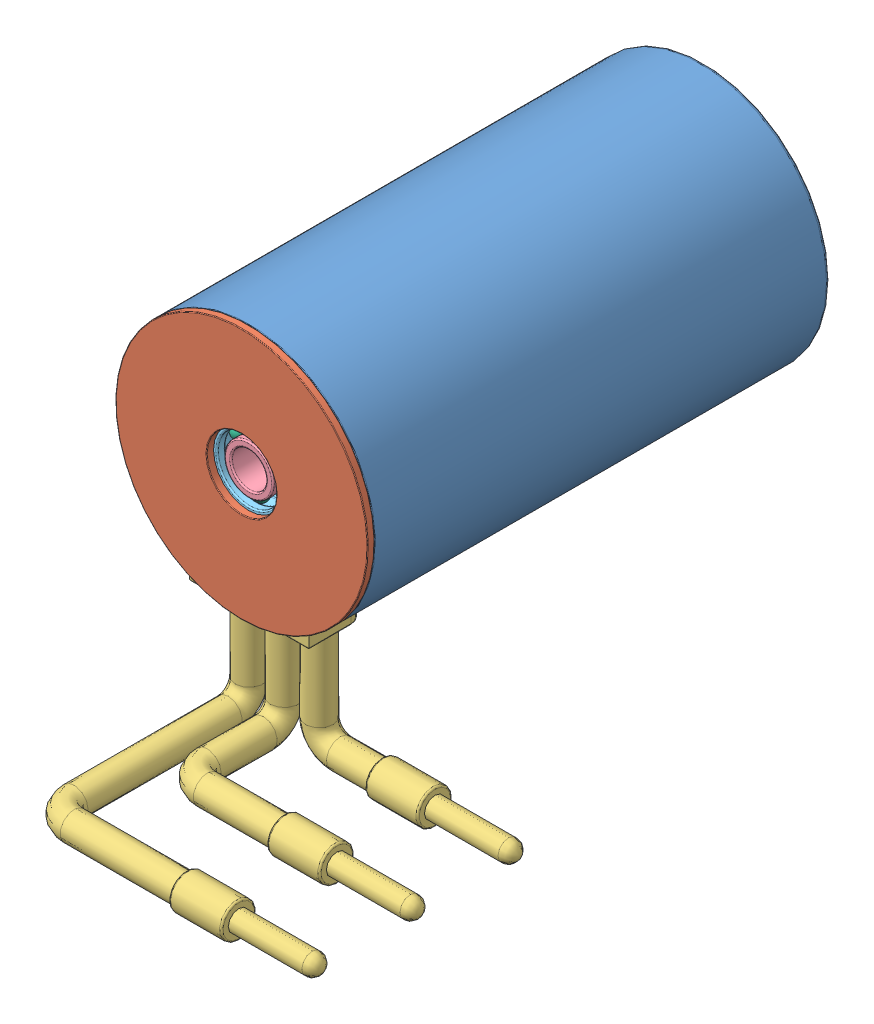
SolidWorks assembly T2M-Moteur Bruschless-Partie fixe.SLDASM, configuration Défaut (file format 6000). Lengths in mm.
Overall size (67.52 69.76 90.4).
384 component instances, 9 part files, 11 mates.
Components (placement in the parent):
- T2M-Moteur Bruschless-Corps-1: T2M-Moteur Bruschless-Corps.SLDPRT [Défaut] at origin size (36 36 65)
- T2M-Moteur Bruschless-Fond-1: T2M-Moteur Bruschless-Fond.SLDPRT [Défaut] at (0 0 66) x (-0.00501 -0.999987 0) z (0 0 -1) size (36 36 5)
- T2M-Moteur Bruschless-Connexion-1: T2M-Moteur Bruschless-Connexion.SLDPRT [Défaut] at (33.5 -33.5 59.9) x (0 1 0) z (-1 0 0) size (24.25 37.5 42)
- T2M-Moteur Bruschless-Roulement-1: T2M-Moteur Bruschless-Roulement.SLDASM [Défaut] at (0 0 63) x (0 0 1) z (-0.965868 -0.259035 0) size (4 11 11)
  - T2M-Moteur Brushless-Roulement-5x4-BI-1: T2M-Moteur Brushless-Roulement-5x4-BI.SLDPRT [Défaut] at origin size (4 7 7)
  - T2M-Moteur Brushless-Roulement-5x4-BE-1: T2M-Moteur Brushless-Roulement-5x4-BE.SLDPRT [Défaut] at origin size (4 11 11)
  - T2M-Moteur Brushless-Roulement-Bille-1: T2M-Moteur Brushless-Roulement-Bille.SLDPRT [Défaut] at (0 0.8608 -3.9063) size (2 2 2)
  - T2M-Moteur Brushless-Roulement-Bille-2: T2M-Moteur Brushless-Roulement-Bille.SLDPRT [Défaut] at (0 3.8133 -1.2076) x (1 0 0) z (0 -0.866025 0.5) size (2 2 2)
  - T2M-Moteur Brushless-Roulement-Bille-3: T2M-Moteur Brushless-Roulement-Bille.SLDPRT [Défaut] at (0 2.9525 2.6986) x (1 0 0) z (0 -0.866025 -0.5) size (2 2 2)
  - T2M-Moteur Brushless-Roulement-Bille-4: T2M-Moteur Brushless-Roulement-Bille.SLDPRT [Défaut] at (0 -0.8608 3.9063) x (1 0 0) z (0 0 -1) size (2 2 2)
  - T2M-Moteur Brushless-Roulement-Bille-5: T2M-Moteur Brushless-Roulement-Bille.SLDPRT [Défaut] at (0 -3.8133 1.2076) x (1 0 0) z (0 0.866025 -0.5) size (2 2 2)
  - T2M-Moteur Brushless-Roulement-Bille-6: T2M-Moteur Brushless-Roulement-Bille.SLDPRT [Défaut] at (0 -2.9525 -2.6986) x (1 0 0) z (0 0.866025 0.5) size (2 2 2)
- T2M-Moteur Bruschless-Roulement-2: T2M-Moteur Bruschless-Roulement.SLDASM [Défaut] at (0 0 3) x (0 0 1) z (-0.961556 0.274609 0) size (4 11 11)
  - T2M-Moteur Brushless-Roulement-5x4-BI-1: T2M-Moteur Brushless-Roulement-5x4-BI.SLDPRT [Défaut] at origin size (4 7 7)
  - T2M-Moteur Brushless-Roulement-5x4-BE-1: T2M-Moteur Brushless-Roulement-5x4-BE.SLDPRT [Défaut] at origin size (4 11 11)
  - T2M-Moteur Brushless-Roulement-Bille-1: T2M-Moteur Brushless-Roulement-Bille.SLDPRT [Défaut] at (0 0.8608 -3.9063) size (2 2 2)
  - T2M-Moteur Brushless-Roulement-Bille-2: T2M-Moteur Brushless-Roulement-Bille.SLDPRT [Défaut] at (0 3.8133 -1.2076) x (1 0 0) z (0 -0.866025 0.5) size (2 2 2)
  - T2M-Moteur Brushless-Roulement-Bille-3: T2M-Moteur Brushless-Roulement-Bille.SLDPRT [Défaut] at (0 2.9525 2.6986) x (1 0 0) z (0 -0.866025 -0.5) size (2 2 2)
  - T2M-Moteur Brushless-Roulement-Bille-4: T2M-Moteur Brushless-Roulement-Bille.SLDPRT [Défaut] at (0 -0.8608 3.9063) x (1 0 0) z (0 0 -1) size (2 2 2)
  - T2M-Moteur Brushless-Roulement-Bille-5: T2M-Moteur Brushless-Roulement-Bille.SLDPRT [Défaut] at (0 -3.8133 1.2076) x (1 0 0) z (0 0.866025 -0.5) size (2 2 2)
  - T2M-Moteur Brushless-Roulement-Bille-6: T2M-Moteur Brushless-Roulement-Bille.SLDPRT [Défaut] at (0 -2.9525 -2.6986) x (1 0 0) z (0 0.866025 0.5) size (2 2 2)
- T2M-Moteur Bruschless-Stator bobine-1: T2M-Moteur Bruschless-Stator bobine.SLDASM [Défaut] at (0 0 11) x (0.778079 -0.628167 0) z (0 0 1) size (48.02 48.02 49.2)
  - T2M-Moteur Bruschless-Stator-1: T2M-Moteur Bruschless-Stator.SLDPRT [Défaut] at origin size (34 34 34.5)
  - T2M-Moteur Bruschless-Fil bobinage-1: T2M-Moteur Bruschless-Fil bobinage.SLDPRT [Défaut] at (7.9212 9.5445 -7.2784) x (0 0 1) z (-0.181516 -0.983388 0) size (49.2 14.21 0.2)
  - T2M-Moteur Bruschless-Fil bobinage-2: T2M-Moteur Bruschless-Fil bobinage.SLDPRT [Défaut] at (8.0866 9.4048 -7.2784) x (0 0 1) z (-0.198651 -0.98007 0) size (49.2 14.21 0.2)
  - T2M-Moteur Bruschless-Fil bobinage-3: T2M-Moteur Bruschless-Fil bobinage.SLDPRT [Défaut] at (8.2495 9.2622 -7.2784) x (0 0 1) z (-0.215725 -0.976454 0) size (49.2 14.21 0.2)
  - T2M-Moteur Bruschless-Fil bobinage-4: T2M-Moteur Bruschless-Fil bobinage.SLDPRT [Défaut] at (8.4099 9.1168 -7.2784) x (0 0 1) z (-0.232734 -0.972541 0) size (49.2 14.21 0.2)
  - T2M-Moteur Bruschless-Fil bobinage-5: T2M-Moteur Bruschless-Fil bobinage.SLDPRT [Défaut] at (8.5677 8.9687 -7.2784) x (0 0 1) z (-0.249671 -0.968331 0) size (49.2 14.21 0.2)
  - T2M-Moteur Bruschless-Fil bobinage-6: T2M-Moteur Bruschless-Fil bobinage.SLDPRT [Défaut] at (8.7229 8.8178 -7.2784) x (0 0 1) z (-0.266533 -0.963826 0) size (49.2 14.21 0.2)
  - T2M-Moteur Bruschless-Fil bobinage-7: T2M-Moteur Bruschless-Fil bobinage.SLDPRT [Défaut] at (8.8755 8.6642 -7.2784) x (0 0 1) z (-0.283314 -0.959027 0) size (49.2 14.21 0.2)
  - T2M-Moteur Bruschless-Fil bobinage-8: T2M-Moteur Bruschless-Fil bobinage.SLDPRT [Défaut] at (9.0253 8.508 -7.2784) x (0 0 1) z (-0.300008 -0.953937 0) size (49.2 14.21 0.2)
  - T2M-Moteur Bruschless-Fil bobinage-9: T2M-Moteur Bruschless-Fil bobinage.SLDPRT [Défaut] at (9.1725 8.3492 -7.2784) x (0 0 1) z (-0.316611 -0.948556 0) size (49.2 14.21 0.2)
  - T2M-Moteur Bruschless-Fil bobinage-10: T2M-Moteur Bruschless-Fil bobinage.SLDPRT [Défaut] at (9.3168 8.1878 -7.2784) x (0 0 1) z (-0.333117 -0.942886 0) size (49.2 14.21 0.2)
  - T2M-Moteur Bruschless-Fil bobinage-11: T2M-Moteur Bruschless-Fil bobinage.SLDPRT [Défaut] at (9.4582 8.024 -7.2784) x (0 0 1) z (-0.349522 -0.936928 0) size (49.2 14.21 0.2)
  - T2M-Moteur Bruschless-Fil bobinage-12: T2M-Moteur Bruschless-Fil bobinage.SLDPRT [Défaut] at (9.5968 7.8577 -7.2784) x (0 0 1) z (-0.36582 -0.930686 0) size (49.2 14.21 0.2)
  - T2M-Moteur Bruschless-Fil bobinage-13: T2M-Moteur Bruschless-Fil bobinage.SLDPRT [Défaut] at (9.7325 7.689 -7.2784) x (0 0 1) z (-0.382007 -0.924159 0) size (49.2 14.21 0.2)
  - T2M-Moteur Bruschless-Fil bobinage-14: T2M-Moteur Bruschless-Fil bobinage.SLDPRT [Défaut] at (9.8652 7.518 -7.2784) x (0 0 1) z (-0.398078 -0.917352 0) size (49.2 14.21 0.2)
  - T2M-Moteur Bruschless-Fil bobinage-15: T2M-Moteur Bruschless-Fil bobinage.SLDPRT [Défaut] at (9.9949 7.3446 -7.2784) x (0 0 1) z (-0.414027 -0.910265 0) size (49.2 14.21 0.2)
  - T2M-Moteur Bruschless-Fil bobinage-16: T2M-Moteur Bruschless-Fil bobinage.SLDPRT [Défaut] at (10.1216 7.1691 -7.2784) x (0 0 1) z (-0.42985 -0.9029 0) size (49.2 14.21 0.2)
  - T2M-Moteur Bruschless-Fil bobinage-17: T2M-Moteur Bruschless-Fil bobinage.SLDPRT [Défaut] at (10.2452 6.9914 -7.2784) x (0 0 1) z (-0.445543 -0.895261 0) size (49.2 14.21 0.2)
  - T2M-Moteur Bruschless-Fil bobinage-18: T2M-Moteur Bruschless-Fil bobinage.SLDPRT [Défaut] at (10.3656 6.8115 -7.2784) x (0 0 1) z (-0.461099 -0.887349 0) size (49.2 14.21 0.2)
  - T2M-Moteur Bruschless-Fil bobinage-19: T2M-Moteur Bruschless-Fil bobinage.SLDPRT [Défaut] at (10.4829 6.6295 -7.2784) x (0 0 1) z (-0.476515 -0.879166 0) size (49.2 14.21 0.2)
  - T2M-Moteur Bruschless-Fil bobinage-20: T2M-Moteur Bruschless-Fil bobinage.SLDPRT [Défaut] at (10.597 6.4456 -7.2784) x (0 0 1) z (-0.491786 -0.870716 0) size (49.2 14.21 0.2)
  - T2M-Moteur Bruschless-Fil bobinage-21: T2M-Moteur Bruschless-Fil bobinage.SLDPRT [Défaut] at (10.7079 6.2597 -7.2784) x (0 0 1) z (-0.506908 -0.862 0) size (49.2 14.21 0.2)
  - T2M-Moteur Bruschless-Fil bobinage-22: T2M-Moteur Bruschless-Fil bobinage.SLDPRT [Défaut] at (10.8155 6.0718 -7.2784) x (0 0 1) z (-0.521874 -0.853022 0) size (49.2 14.21 0.2)
  - T2M-Moteur Bruschless-Fil bobinage-23: T2M-Moteur Bruschless-Fil bobinage.SLDPRT [Défaut] at (10.9198 5.8821 -7.2784) x (0 0 1) z (-0.536682 -0.843784 0) size (49.2 14.21 0.2)
  - T2M-Moteur Bruschless-Fil bobinage-24: T2M-Moteur Bruschless-Fil bobinage.SLDPRT [Défaut] at (11.0208 5.6907 -7.2784) x (0 0 1) z (-0.551327 -0.83429 0) size (49.2 14.21 0.2)
  - T2M-Moteur Bruschless-Fil bobinage-25: T2M-Moteur Bruschless-Fil bobinage.SLDPRT [Défaut] at (11.1185 5.4975 -7.2784) x (0 0 1) z (-0.565803 -0.824541 0) size (49.2 14.21 0.2)
  - T2M-Moteur Bruschless-Fil bobinage-26: T2M-Moteur Bruschless-Fil bobinage.SLDPRT [Défaut] at (11.2127 5.3026 -7.2784) x (0 0 1) z (-0.580107 -0.81454 0) size (49.2 14.21 0.2)
  - T2M-Moteur Bruschless-Fil bobinage-27: T2M-Moteur Bruschless-Fil bobinage.SLDPRT [Défaut] at (11.3036 5.1061 -7.2784) x (0 0 1) z (-0.594234 -0.804292 0) size (49.2 14.21 0.2)
  - T2M-Moteur Bruschless-Fil bobinage-28: T2M-Moteur Bruschless-Fil bobinage.SLDPRT [Défaut] at (11.3909 4.908 -7.2784) x (0 0 1) z (-0.608181 -0.793799 0) size (49.2 14.21 0.2)
  - T2M-Moteur Bruschless-Fil bobinage-29: T2M-Moteur Bruschless-Fil bobinage.SLDPRT [Défaut] at (11.4749 4.7085 -7.2784) x (0 0 1) z (-0.621942 -0.783064 0) size (49.2 14.21 0.2)
  - T2M-Moteur Bruschless-Fil bobinage-30: T2M-Moteur Bruschless-Fil bobinage.SLDPRT [Défaut] at (11.5553 4.5075 -7.2784) x (0 0 1) z (-0.635513 -0.77209 0) size (49.2 14.21 0.2)
  - T2M-Moteur Bruschless-Fil bobinage-31: T2M-Moteur Bruschless-Fil bobinage.SLDPRT [Défaut] at (11.6322 4.3052 -7.2784) x (0 0 1) z (-0.648891 -0.760881 0) size (49.2 14.21 0.2)
  - T2M-Moteur Bruschless-Fil bobinage-32: T2M-Moteur Bruschless-Fil bobinage.SLDPRT [Défaut] at (11.7056 4.1015 -7.2784) x (0 0 1) z (-0.662072 -0.74944 0) size (49.2 14.21 0.2)
  - T2M-Moteur Bruschless-Fil bobinage-33: T2M-Moteur Bruschless-Fil bobinage.SLDPRT [Défaut] at (11.7754 3.8966 -7.2784) x (0 0 1) z (-0.67505 -0.737772 0) size (49.2 14.21 0.2)
  - T2M-Moteur Bruschless-Fil bobinage-34: T2M-Moteur Bruschless-Fil bobinage.SLDPRT [Défaut] at (11.8416 3.6905 -7.2784) x (0 0 1) z (-0.687824 -0.725878 0) size (49.2 14.21 0.2)
  - T2M-Moteur Bruschless-Fil bobinage-35: T2M-Moteur Bruschless-Fil bobinage.SLDPRT [Défaut] at (11.9042 3.4832 -7.2784) x (0 0 1) z (-0.700387 -0.713763 0) size (49.2 14.21 0.2)
  - T2M-Moteur Bruschless-Fil bobinage-36: T2M-Moteur Bruschless-Fil bobinage.SLDPRT [Défaut] at (11.9632 3.275 -7.2784) x (0 0 1) z (-0.712737 -0.701431 0) size (49.2 14.21 0.2)
  - T2M-Moteur Bruschless-Fil bobinage-37: T2M-Moteur Bruschless-Fil bobinage.SLDPRT [Défaut] at (12.0185 3.0657 -7.2784) x (0 0 1) z (-0.72487 -0.688885 0) size (49.2 14.21 0.2)
  - T2M-Moteur Bruschless-Fil bobinage-38: T2M-Moteur Bruschless-Fil bobinage.SLDPRT [Défaut] at (12.0702 2.8555 -7.2784) x (0 0 1) z (-0.736783 -0.67613 0) size (49.2 14.21 0.2)
  - T2M-Moteur Bruschless-Fil bobinage-39: T2M-Moteur Bruschless-Fil bobinage.SLDPRT [Défaut] at (12.1182 2.6444 -7.2784) x (0 0 1) z (-0.748471 -0.663168 0) size (49.2 14.21 0.2)
  - T2M-Moteur Bruschless-Fil bobinage-40: T2M-Moteur Bruschless-Fil bobinage.SLDPRT [Défaut] at (12.1625 2.4325 -7.2784) x (0 0 1) z (-0.75993 -0.650004 0) size (49.2 14.21 0.2)
  - T2M-Moteur Bruschless-Fil bobinage-41: T2M-Moteur Bruschless-Fil bobinage.SLDPRT [Défaut] at (12.2031 2.2198 -7.2784) x (0 0 1) z (-0.771159 -0.636643 0) size (49.2 14.21 0.2)
  - T2M-Moteur Bruschless-Fil bobinage-42: T2M-Moteur Bruschless-Fil bobinage.SLDPRT [Défaut] at (12.24 2.0065 -7.2784) x (0 0 1) z (-0.782152 -0.623087 0) size (49.2 14.21 0.2)
  - T2M-Moteur Bruschless-Fil bobinage-43: T2M-Moteur Bruschless-Fil bobinage.SLDPRT [Défaut] at (12.2731 1.7926 -7.2784) x (0 0 1) z (-0.792908 -0.609342 0) size (49.2 14.21 0.2)
  - T2M-Moteur Bruschless-Fil bobinage-44: T2M-Moteur Bruschless-Fil bobinage.SLDPRT [Défaut] at (12.3025 1.5781 -7.2784) x (0 0 1) z (-0.803421 -0.595411 0) size (49.2 14.21 0.2)
  - T2M-Moteur Bruschless-Fil bobinage-45: T2M-Moteur Bruschless-Fil bobinage.SLDPRT [Défaut] at (12.3282 1.3632 -7.2784) x (0 0 1) z (-0.81369 -0.581299 0) size (49.2 14.21 0.2)
  - T2M-Moteur Bruschless-Fil bobinage-46: T2M-Moteur Bruschless-Fil bobinage.SLDPRT [Défaut] at (12.3501 1.1478 -7.2784) x (0 0 1) z (-0.823711 -0.567009 0) size (49.2 14.21 0.2)
  - T2M-Moteur Bruschless-Fil bobinage-47: T2M-Moteur Bruschless-Fil bobinage.SLDPRT [Défaut] at (12.3683 0.9321 -7.2784) x (0 0 1) z (-0.833482 -0.552547 0) size (49.2 14.21 0.2)
  - T2M-Moteur Bruschless-Fil bobinage-48: T2M-Moteur Bruschless-Fil bobinage.SLDPRT [Défaut] at (12.3826 0.7161 -7.2784) x (0 0 1) z (-0.842998 -0.537917 0) size (49.2 14.21 0.2)
  - T2M-Moteur Bruschless-Fil bobinage-49: T2M-Moteur Bruschless-Fil bobinage.SLDPRT [Défaut] at (12.3933 0.4999 -7.2784) x (0 0 1) z (-0.852258 -0.523122 0) size (49.2 14.21 0.2)
  - T2M-Moteur Bruschless-Fil bobinage-50: T2M-Moteur Bruschless-Fil bobinage.SLDPRT [Défaut] at (12.4001 0.2835 -7.2784) x (0 0 1) z (-0.861257 -0.508169 0) size (49.2 14.21 0.2)
  - T2M-Moteur Bruschless-Fil bobinage-51: T2M-Moteur Bruschless-Fil bobinage.SLDPRT [Défaut] at (12.4031 0.0671 -7.2784) x (0 0 1) z (-0.869995 -0.49306 0) size (49.2 14.21 0.2)
  - T2M-Moteur Bruschless-Fil bobinage-52: T2M-Moteur Bruschless-Fil bobinage.SLDPRT [Défaut] at (12.4024 -0.1494 -7.2784) x (0 0 1) z (-0.878468 -0.477802 0) size (49.2 14.21 0.2)
  - T2M-Moteur Bruschless-Fil bobinage-53: T2M-Moteur Bruschless-Fil bobinage.SLDPRT [Défaut] at (12.3979 -0.3658 -7.2784) x (0 0 1) z (-0.886673 -0.462398 0) size (49.2 14.21 0.2)
  - T2M-Moteur Bruschless-Fil bobinage-54: T2M-Moteur Bruschless-Fil bobinage.SLDPRT [Défaut] at (12.3897 -0.5821 -7.2784) x (0 0 1) z (-0.894608 -0.446853 0) size (49.2 14.21 0.2)
  - T2M-Moteur Bruschless-Fil bobinage-55: T2M-Moteur Bruschless-Fil bobinage.SLDPRT [Défaut] at (12.3776 -0.7983 -7.2784) x (0 0 1) z (-0.90227 -0.431172 0) size (49.2 14.21 0.2)
  - T2M-Moteur Bruschless-Fil bobinage-56: T2M-Moteur Bruschless-Fil bobinage.SLDPRT [Défaut] at (12.3618 -1.0142 -7.2784) x (0 0 1) z (-0.909658 -0.415359 0) size (49.2 14.21 0.2)
  - T2M-Moteur Bruschless-Fil bobinage-57: T2M-Moteur Bruschless-Fil bobinage.SLDPRT [Défaut] at (12.3422 -1.2298 -7.2784) x (0 0 1) z (-0.916768 -0.39942 0) size (49.2 14.21 0.2)
  - T2M-Moteur Bruschless-Fil bobinage-58: T2M-Moteur Bruschless-Fil bobinage.SLDPRT [Défaut] at (12.3189 -1.445 -7.2784) x (0 0 1) z (-0.923599 -0.383359 0) size (49.2 14.21 0.2)
  - T2M-Moteur Bruschless-Fil bobinage-59: T2M-Moteur Bruschless-Fil bobinage.SLDPRT [Défaut] at (12.2918 -1.6598 -7.2784) x (0 0 1) z (-0.930149 -0.367182 0) size (49.2 14.21 0.2)
  - T2M-Moteur Bruschless-Fil bobinage-60: T2M-Moteur Bruschless-Fil bobinage.SLDPRT [Défaut] at (12.2609 -1.874 -7.2784) x (0 0 1) z (-0.936416 -0.350893 0) size (49.2 14.21 0.2)
  - T2M-Moteur Bruschless-Fil bobinage-61: T2M-Moteur Bruschless-Fil bobinage.SLDPRT [Défaut] at (12.2264 -2.0877 -7.2784) x (0 0 1) z (-0.942397 -0.334497 0) size (49.2 14.21 0.2)
  - T2M-Moteur Bruschless-Fil bobinage-62: T2M-Moteur Bruschless-Fil bobinage.SLDPRT [Défaut] at (12.1881 -2.3008 -7.2784) x (0 0 1) z (-0.948091 -0.317999 0) size (49.2 14.21 0.2)
  - T2M-Moteur Bruschless-Fil bobinage-63: T2M-Moteur Bruschless-Fil bobinage.SLDPRT [Défaut] at (12.1461 -2.5132 -7.2784) x (0 0 1) z (-0.953497 -0.301404 0) size (49.2 14.21 0.2)
  - T2M-Moteur Bruschless-Fil bobinage-64: T2M-Moteur Bruschless-Fil bobinage.SLDPRT [Défaut] at (12.1003 -2.7247 -7.2784) x (0 0 1) z (-0.958612 -0.284717 0) size (49.2 14.21 0.2)
  - T2M-Moteur Bruschless-Fil bobinage-65: T2M-Moteur Bruschless-Fil bobinage.SLDPRT [Défaut] at (12.0509 -2.9355 -7.2784) x (0 0 1) z (-0.963435 -0.267944 0) size (49.2 14.21 0.2)
  - T2M-Moteur Bruschless-Fil bobinage-66: T2M-Moteur Bruschless-Fil bobinage.SLDPRT [Défaut] at (11.9979 -3.1454 -7.2784) x (0 0 1) z (-0.967964 -0.251089 0) size (49.2 14.21 0.2)
  - T2M-Moteur Bruschless-Fil bobinage-67: T2M-Moteur Bruschless-Fil bobinage.SLDPRT [Défaut] at (11.9412 -3.3543 -7.2784) x (0 0 1) z (-0.972199 -0.234157 0) size (49.2 14.21 0.2)
  - T2M-Moteur Bruschless-Fil bobinage-68: T2M-Moteur Bruschless-Fil bobinage.SLDPRT [Défaut] at (11.8808 -3.5622 -7.2784) x (0 0 1) z (-0.976137 -0.217154 0) size (49.2 14.21 0.2)
  - T2M-Moteur Bruschless-Fil bobinage-69: T2M-Moteur Bruschless-Fil bobinage.SLDPRT [Défaut] at (11.8168 -3.769 -7.2784) x (0 0 1) z (-0.979779 -0.200085 0) size (49.2 14.21 0.2)
  - T2M-Moteur Bruschless-Fil bobinage-70: T2M-Moteur Bruschless-Fil bobinage.SLDPRT [Défaut] at (11.7492 -3.9747 -7.2784) x (0 0 1) z (-0.983121 -0.182955 0) size (49.2 14.21 0.2)
  - T2M-Moteur Bruschless-Fil bobinage-71: T2M-Moteur Bruschless-Fil bobinage.SLDPRT [Défaut] at (11.6781 -4.1791 -7.2784) x (0 0 1) z (-0.986165 -0.165769 0) size (49.2 14.21 0.2)
  - T2M-Moteur Bruschless-Fil bobinage-72: T2M-Moteur Bruschless-Fil bobinage.SLDPRT [Défaut] at (11.6034 -4.3823 -7.2784) x (0 0 1) z (-0.988907 -0.148533 0) size (49.2 14.21 0.2)
  - T2M-Moteur Bruschless-Fil bobinage-73: T2M-Moteur Bruschless-Fil bobinage.SLDPRT [Défaut] at (11.5251 -4.5841 -7.2784) x (0 0 1) z (-0.991349 -0.131252 0) size (49.2 14.21 0.2)
  - T2M-Moteur Bruschless-Fil bobinage-74: T2M-Moteur Bruschless-Fil bobinage.SLDPRT [Défaut] at (11.4434 -4.7846 -7.2784) x (0 0 1) z (-0.993489 -0.11393 0) size (49.2 14.21 0.2)
  - T2M-Moteur Bruschless-Fil bobinage-75: T2M-Moteur Bruschless-Fil bobinage.SLDPRT [Défaut] at (11.3581 -4.9835 -7.2784) x (0 0 1) z (-0.995326 -0.096574 0) size (49.2 14.21 0.2)
  - T2M-Moteur Bruschless-Fil bobinage-76: T2M-Moteur Bruschless-Fil bobinage.SLDPRT [Défaut] at (11.2694 -5.181 -7.2784) x (0 0 1) z (-0.99686 -0.079189 0) size (49.2 14.21 0.2)
  - T2M-Moteur Bruschless-Fil bobinage-77: T2M-Moteur Bruschless-Fil bobinage.SLDPRT [Défaut] at (11.1773 -5.3769 -7.2784) x (0 0 1) z (-0.99809 -0.061779 0) size (49.2 14.21 0.2)
  - T2M-Moteur Bruschless-Fil bobinage-78: T2M-Moteur Bruschless-Fil bobinage.SLDPRT [Défaut] at (11.0817 -5.5711 -7.2784) x (0 0 1) z (-0.999016 -0.044351 0) size (49.2 14.21 0.2)
  - T2M-Moteur Bruschless-Fil bobinage-79: T2M-Moteur Bruschless-Fil bobinage.SLDPRT [Défaut] at (10.9828 -5.7637 -7.2784) x (0 0 1) z (-0.999638 -0.026909 0) size (49.2 14.21 0.2)
  - T2M-Moteur Bruschless-Fil bobinage-80: T2M-Moteur Bruschless-Fil bobinage.SLDPRT [Défaut] at (10.8806 -5.9545 -7.2784) x (0 0 1) z (-0.999955 -0.009458 0) size (49.2 14.21 0.2)
  - T2M-Moteur Bruschless-Fil bobinage-81: T2M-Moteur Bruschless-Fil bobinage.SLDPRT [Défaut] at (10.775 -6.1435 -7.2784) x (0 0 1) z (-0.999968 0.007995 0) size (49.2 14.21 0.2)
  - T2M-Moteur Bruschless-Fil bobinage-82: T2M-Moteur Bruschless-Fil bobinage.SLDPRT [Défaut] at (10.6661 -6.3306 -7.2784) x (0 0 1) z (-0.999676 0.025445 0) size (49.2 14.21 0.2)
  - T2M-Moteur Bruschless-Fil bobinage-83: T2M-Moteur Bruschless-Fil bobinage.SLDPRT [Défaut] at (10.554 -6.5158 -7.2784) x (0 0 1) z (-0.99908 0.042888 0) size (49.2 14.21 0.2)
  - T2M-Moteur Bruschless-Fil bobinage-84: T2M-Moteur Bruschless-Fil bobinage.SLDPRT [Défaut] at (10.4387 -6.699 -7.2784) x (0 0 1) z (-0.998179 0.060318 0) size (49.2 14.21 0.2)
  - T2M-Moteur Bruschless-Fil bobinage-85: T2M-Moteur Bruschless-Fil bobinage.SLDPRT [Défaut] at (10.3202 -6.8801 -7.2784) x (0 0 1) z (-0.996974 0.077729 0) size (49.2 14.21 0.2)
  - T2M-Moteur Bruschless-Fil bobinage-86: T2M-Moteur Bruschless-Fil bobinage.SLDPRT [Défaut] at (10.1985 -7.0592 -7.2784) x (0 0 1) z (-0.995466 0.095117 0) size (49.2 14.21 0.2)
  - T2M-Moteur Bruschless-Fil bobinage-87: T2M-Moteur Bruschless-Fil bobinage.SLDPRT [Défaut] at (10.0738 -7.2361 -7.2784) x (0 0 1) z (-0.993654 0.112476 0) size (49.2 14.21 0.2)
  - T2M-Moteur Bruschless-Fil bobinage-88: T2M-Moteur Bruschless-Fil bobinage.SLDPRT [Défaut] at (9.946 -7.4108 -7.2784) x (0 0 1) z (-0.99154 0.129801 0) size (49.2 14.21 0.2)
  - T2M-Moteur Bruschless-Fil bobinage-89: T2M-Moteur Bruschless-Fil bobinage.SLDPRT [Défaut] at (9.8151 -7.5833 -7.2784) x (0 0 1) z (-0.989124 0.147086 0) size (49.2 14.21 0.2)
  - T2M-Moteur Bruschless-Fil bobinage-90: T2M-Moteur Bruschless-Fil bobinage.SLDPRT [Défaut] at (9.6813 -7.7534 -7.2784) x (0 0 1) z (-0.986406 0.164326 0) size (49.2 14.21 0.2)
  - T2M-Moteur Bruschless-Fil bobinage-91: T2M-Moteur Bruschless-Fil bobinage.SLDPRT [Défaut] at (9.5445 -7.9212 -7.2784) x (0 0 1) z (-0.983388 0.181516 0) size (49.2 14.21 0.2)
  - T2M-Moteur Bruschless-Fil bobinage-92: T2M-Moteur Bruschless-Fil bobinage.SLDPRT [Défaut] at (9.4048 -8.0866 -7.2784) x (0 0 1) z (-0.98007 0.198651 0) size (49.2 14.21 0.2)
  - T2M-Moteur Bruschless-Fil bobinage-93: T2M-Moteur Bruschless-Fil bobinage.SLDPRT [Défaut] at (9.2622 -8.2495 -7.2784) x (0 0 1) z (-0.976454 0.215725 0) size (49.2 14.21 0.2)
  - T2M-Moteur Bruschless-Fil bobinage-94: T2M-Moteur Bruschless-Fil bobinage.SLDPRT [Défaut] at (9.1168 -8.4099 -7.2784) x (0 0 1) z (-0.972541 0.232734 0) size (49.2 14.21 0.2)
  - T2M-Moteur Bruschless-Fil bobinage-95: T2M-Moteur Bruschless-Fil bobinage.SLDPRT [Défaut] at (8.9687 -8.5677 -7.2784) x (0 0 1) z (-0.968331 0.249671 0) size (49.2 14.21 0.2)
  - T2M-Moteur Bruschless-Fil bobinage-96: T2M-Moteur Bruschless-Fil bobinage.SLDPRT [Défaut] at (8.8178 -8.7229 -7.2784) x (0 0 1) z (-0.963826 0.266533 0) size (49.2 14.21 0.2)
  - T2M-Moteur Bruschless-Fil bobinage-97: T2M-Moteur Bruschless-Fil bobinage.SLDPRT [Défaut] at (8.6642 -8.8755 -7.2784) x (0 0 1) z (-0.959027 0.283314 0) size (49.2 14.21 0.2)
  - T2M-Moteur Bruschless-Fil bobinage-98: T2M-Moteur Bruschless-Fil bobinage.SLDPRT [Défaut] at (8.508 -9.0253 -7.2784) x (0 0 1) z (-0.953937 0.300008 0) size (49.2 14.21 0.2)
  - T2M-Moteur Bruschless-Fil bobinage-99: T2M-Moteur Bruschless-Fil bobinage.SLDPRT [Défaut] at (8.3492 -9.1725 -7.2784) x (0 0 1) z (-0.948556 0.316611 0) size (49.2 14.21 0.2)
  - T2M-Moteur Bruschless-Fil bobinage-100: T2M-Moteur Bruschless-Fil bobinage.SLDPRT [Défaut] at (8.1878 -9.3168 -7.2784) x (0 0 1) z (-0.942886 0.333117 0) size (49.2 14.21 0.2)
  - T2M-Moteur Bruschless-Fil bobinage-101: T2M-Moteur Bruschless-Fil bobinage.SLDPRT [Défaut] at (8.024 -9.4582 -7.2784) x (0 0 1) z (-0.936928 0.349522 0) size (49.2 14.21 0.2)
  - T2M-Moteur Bruschless-Fil bobinage-102: T2M-Moteur Bruschless-Fil bobinage.SLDPRT [Défaut] at (7.8577 -9.5968 -7.2784) x (0 0 1) z (-0.930686 0.36582 0) size (49.2 14.21 0.2)
  - T2M-Moteur Bruschless-Fil bobinage-103: T2M-Moteur Bruschless-Fil bobinage.SLDPRT [Défaut] at (7.689 -9.7325 -7.2784) x (0 0 1) z (-0.924159 0.382007 0) size (49.2 14.21 0.2)
  - T2M-Moteur Bruschless-Fil bobinage-104: T2M-Moteur Bruschless-Fil bobinage.SLDPRT [Défaut] at (7.518 -9.8652 -7.2784) x (0 0 1) z (-0.917352 0.398078 0) size (49.2 14.21 0.2)
  - T2M-Moteur Bruschless-Fil bobinage-105: T2M-Moteur Bruschless-Fil bobinage.SLDPRT [Défaut] at (7.3446 -9.9949 -7.2784) x (0 0 1) z (-0.910265 0.414027 0) size (49.2 14.21 0.2)
  - T2M-Moteur Bruschless-Fil bobinage-106: T2M-Moteur Bruschless-Fil bobinage.SLDPRT [Défaut] at (7.1691 -10.1216 -7.2784) x (0 0 1) z (-0.9029 0.42985 0) size (49.2 14.21 0.2)
  - T2M-Moteur Bruschless-Fil bobinage-107: T2M-Moteur Bruschless-Fil bobinage.SLDPRT [Défaut] at (6.9914 -10.2452 -7.2784) x (0 0 1) z (-0.895261 0.445543 0) size (49.2 14.21 0.2)
  - T2M-Moteur Bruschless-Fil bobinage-108: T2M-Moteur Bruschless-Fil bobinage.SLDPRT [Défaut] at (6.8115 -10.3656 -7.2784) x (0 0 1) z (-0.887349 0.461099 0) size (49.2 14.21 0.2)
  - T2M-Moteur Bruschless-Fil bobinage-109: T2M-Moteur Bruschless-Fil bobinage.SLDPRT [Défaut] at (6.6295 -10.4829 -7.2784) x (0 0 1) z (-0.879166 0.476515 0) size (49.2 14.21 0.2)
  - T2M-Moteur Bruschless-Fil bobinage-110: T2M-Moteur Bruschless-Fil bobinage.SLDPRT [Défaut] at (6.4456 -10.597 -7.2784) x (0 0 1) z (-0.870716 0.491786 0) size (49.2 14.21 0.2)
  - T2M-Moteur Bruschless-Fil bobinage-111: T2M-Moteur Bruschless-Fil bobinage.SLDPRT [Défaut] at (6.2597 -10.7079 -7.2784) x (0 0 1) z (-0.862 0.506908 0) size (49.2 14.21 0.2)
  - T2M-Moteur Bruschless-Fil bobinage-112: T2M-Moteur Bruschless-Fil bobinage.SLDPRT [Défaut] at (6.0718 -10.8155 -7.2784) x (0 0 1) z (-0.853022 0.521874 0) size (49.2 14.21 0.2)
  - T2M-Moteur Bruschless-Fil bobinage-113: T2M-Moteur Bruschless-Fil bobinage.SLDPRT [Défaut] at (5.8821 -10.9198 -7.2784) x (0 0 1) z (-0.843784 0.536682 0) size (49.2 14.21 0.2)
  - T2M-Moteur Bruschless-Fil bobinage-114: T2M-Moteur Bruschless-Fil bobinage.SLDPRT [Défaut] at (5.6907 -11.0208 -7.2784) x (0 0 1) z (-0.83429 0.551327 0) size (49.2 14.21 0.2)
  - T2M-Moteur Bruschless-Fil bobinage-115: T2M-Moteur Bruschless-Fil bobinage.SLDPRT [Défaut] at (5.4975 -11.1185 -7.2784) x (0 0 1) z (-0.824541 0.565803 0) size (49.2 14.21 0.2)
  - T2M-Moteur Bruschless-Fil bobinage-116: T2M-Moteur Bruschless-Fil bobinage.SLDPRT [Défaut] at (5.3026 -11.2127 -7.2784) x (0 0 1) z (-0.81454 0.580107 0) size (49.2 14.21 0.2)
  - T2M-Moteur Bruschless-Fil bobinage-117: T2M-Moteur Bruschless-Fil bobinage.SLDPRT [Défaut] at (5.1061 -11.3036 -7.2784) x (0 0 1) z (-0.804292 0.594234 0) size (49.2 14.21 0.2)
  - T2M-Moteur Bruschless-Fil bobinage-118: T2M-Moteur Bruschless-Fil bobinage.SLDPRT [Défaut] at (4.908 -11.3909 -7.2784) x (0 0 1) z (-0.793799 0.608181 0) size (49.2 14.21 0.2)
  - T2M-Moteur Bruschless-Fil bobinage-119: T2M-Moteur Bruschless-Fil bobinage.SLDPRT [Défaut] at (4.7085 -11.4749 -7.2784) x (0 0 1) z (-0.783064 0.621942 0) size (49.2 14.21 0.2)
  - T2M-Moteur Bruschless-Fil bobinage-120: T2M-Moteur Bruschless-Fil bobinage.SLDPRT [Défaut] at (4.5075 -11.5553 -7.2784) x (0 0 1) z (-0.77209 0.635513 0) size (49.2 14.21 0.2)
  - T2M-Moteur Bruschless-Fil bobinage-121: T2M-Moteur Bruschless-Fil bobinage.SLDPRT [Défaut] at (4.3052 -11.6322 -7.2784) x (0 0 1) z (-0.760881 0.648891 0) size (49.2 14.21 0.2)
  - T2M-Moteur Bruschless-Fil bobinage-122: T2M-Moteur Bruschless-Fil bobinage.SLDPRT [Défaut] at (4.1015 -11.7056 -7.2784) x (0 0 1) z (-0.74944 0.662072 0) size (49.2 14.21 0.2)
  - T2M-Moteur Bruschless-Fil bobinage-123: T2M-Moteur Bruschless-Fil bobinage.SLDPRT [Défaut] at (3.8966 -11.7754 -7.2784) x (0 0 1) z (-0.737772 0.67505 0) size (49.2 14.21 0.2)
  - T2M-Moteur Bruschless-Fil bobinage-124: T2M-Moteur Bruschless-Fil bobinage.SLDPRT [Défaut] at (3.6905 -11.8416 -7.2784) x (0 0 1) z (-0.725878 0.687824 0) size (49.2 14.21 0.2)
  - T2M-Moteur Bruschless-Fil bobinage-125: T2M-Moteur Bruschless-Fil bobinage.SLDPRT [Défaut] at (3.4832 -11.9042 -7.2784) x (0 0 1) z (-0.713763 0.700387 0) size (49.2 14.21 0.2)
  - T2M-Moteur Bruschless-Fil bobinage-126: T2M-Moteur Bruschless-Fil bobinage.SLDPRT [Défaut] at (3.275 -11.9632 -7.2784) x (0 0 1) z (-0.701431 0.712737 0) size (49.2 14.21 0.2)
  - T2M-Moteur Bruschless-Fil bobinage-127: T2M-Moteur Bruschless-Fil bobinage.SLDPRT [Défaut] at (3.0657 -12.0185 -7.2784) x (0 0 1) z (-0.688885 0.72487 0) size (49.2 14.21 0.2)
  - T2M-Moteur Bruschless-Fil bobinage-128: T2M-Moteur Bruschless-Fil bobinage.SLDPRT [Défaut] at (2.8555 -12.0702 -7.2784) x (0 0 1) z (-0.67613 0.736783 0) size (49.2 14.21 0.2)
  - T2M-Moteur Bruschless-Fil bobinage-129: T2M-Moteur Bruschless-Fil bobinage.SLDPRT [Défaut] at (2.6444 -12.1182 -7.2784) x (0 0 1) z (-0.663168 0.748471 0) size (49.2 14.21 0.2)
  - T2M-Moteur Bruschless-Fil bobinage-130: T2M-Moteur Bruschless-Fil bobinage.SLDPRT [Défaut] at (2.4325 -12.1625 -7.2784) x (0 0 1) z (-0.650004 0.75993 0) size (49.2 14.21 0.2)
  - T2M-Moteur Bruschless-Fil bobinage-131: T2M-Moteur Bruschless-Fil bobinage.SLDPRT [Défaut] at (2.2198 -12.2031 -7.2784) x (0 0 1) z (-0.636643 0.771159 0) size (49.2 14.21 0.2)
  - T2M-Moteur Bruschless-Fil bobinage-132: T2M-Moteur Bruschless-Fil bobinage.SLDPRT [Défaut] at (2.0065 -12.24 -7.2784) x (0 0 1) z (-0.623087 0.782152 0) size (49.2 14.21 0.2)
  - T2M-Moteur Bruschless-Fil bobinage-133: T2M-Moteur Bruschless-Fil bobinage.SLDPRT [Défaut] at (1.7926 -12.2731 -7.2784) x (0 0 1) z (-0.609342 0.792908 0) size (49.2 14.21 0.2)
  - T2M-Moteur Bruschless-Fil bobinage-134: T2M-Moteur Bruschless-Fil bobinage.SLDPRT [Défaut] at (1.5781 -12.3025 -7.2784) x (0 0 1) z (-0.595411 0.803421 0) size (49.2 14.21 0.2)
  - T2M-Moteur Bruschless-Fil bobinage-135: T2M-Moteur Bruschless-Fil bobinage.SLDPRT [Défaut] at (1.3632 -12.3282 -7.2784) x (0 0 1) z (-0.581299 0.81369 0) size (49.2 14.21 0.2)
  - T2M-Moteur Bruschless-Fil bobinage-136: T2M-Moteur Bruschless-Fil bobinage.SLDPRT [Défaut] at (1.1478 -12.3501 -7.2784) x (0 0 1) z (-0.567009 0.823711 0) size (49.2 14.21 0.2)
  - T2M-Moteur Bruschless-Fil bobinage-137: T2M-Moteur Bruschless-Fil bobinage.SLDPRT [Défaut] at (0.9321 -12.3683 -7.2784) x (0 0 1) z (-0.552547 0.833482 0) size (49.2 14.21 0.2)
  - T2M-Moteur Bruschless-Fil bobinage-138: T2M-Moteur Bruschless-Fil bobinage.SLDPRT [Défaut] at (0.7161 -12.3826 -7.2784) x (0 0 1) z (-0.537917 0.842998 0) size (49.2 14.21 0.2)
  - T2M-Moteur Bruschless-Fil bobinage-139: T2M-Moteur Bruschless-Fil bobinage.SLDPRT [Défaut] at (0.4999 -12.3933 -7.2784) x (0 0 1) z (-0.523122 0.852258 0) size (49.2 14.21 0.2)
  - T2M-Moteur Bruschless-Fil bobinage-140: T2M-Moteur Bruschless-Fil bobinage.SLDPRT [Défaut] at (0.2835 -12.4001 -7.2784) x (0 0 1) z (-0.508169 0.861257 0) size (49.2 14.21 0.2)
  - T2M-Moteur Bruschless-Fil bobinage-141: T2M-Moteur Bruschless-Fil bobinage.SLDPRT [Défaut] at (0.0671 -12.4031 -7.2784) x (0 0 1) z (-0.49306 0.869995 0) size (49.2 14.21 0.2)
  - T2M-Moteur Bruschless-Fil bobinage-142: T2M-Moteur Bruschless-Fil bobinage.SLDPRT [Défaut] at (-0.1494 -12.4024 -7.2784) x (0 0 1) z (-0.477802 0.878468 0) size (49.2 14.21 0.2)
  - T2M-Moteur Bruschless-Fil bobinage-143: T2M-Moteur Bruschless-Fil bobinage.SLDPRT [Défaut] at (-0.3658 -12.3979 -7.2784) x (0 0 1) z (-0.462398 0.886673 0) size (49.2 14.21 0.2)
  - T2M-Moteur Bruschless-Fil bobinage-144: T2M-Moteur Bruschless-Fil bobinage.SLDPRT [Défaut] at (-0.5821 -12.3897 -7.2784) x (0 0 1) z (-0.446853 0.894608 0) size (49.2 14.21 0.2)
  - T2M-Moteur Bruschless-Fil bobinage-145: T2M-Moteur Bruschless-Fil bobinage.SLDPRT [Défaut] at (-0.7983 -12.3776 -7.2784) x (0 0 1) z (-0.431172 0.90227 0) size (49.2 14.21 0.2)
  - T2M-Moteur Bruschless-Fil bobinage-146: T2M-Moteur Bruschless-Fil bobinage.SLDPRT [Défaut] at (-1.0142 -12.3618 -7.2784) x (0 0 1) z (-0.415359 0.909658 0) size (49.2 14.21 0.2)
  - T2M-Moteur Bruschless-Fil bobinage-147: T2M-Moteur Bruschless-Fil bobinage.SLDPRT [Défaut] at (-1.2298 -12.3422 -7.2784) x (0 0 1) z (-0.39942 0.916768 0) size (49.2 14.21 0.2)
  - T2M-Moteur Bruschless-Fil bobinage-148: T2M-Moteur Bruschless-Fil bobinage.SLDPRT [Défaut] at (-1.445 -12.3189 -7.2784) x (0 0 1) z (-0.383359 0.923599 0) size (49.2 14.21 0.2)
  - T2M-Moteur Bruschless-Fil bobinage-149: T2M-Moteur Bruschless-Fil bobinage.SLDPRT [Défaut] at (-1.6598 -12.2918 -7.2784) x (0 0 1) z (-0.367182 0.930149 0) size (49.2 14.21 0.2)
  - T2M-Moteur Bruschless-Fil bobinage-150: T2M-Moteur Bruschless-Fil bobinage.SLDPRT [Défaut] at (-1.874 -12.2609 -7.2784) x (0 0 1) z (-0.350893 0.936416 0) size (49.2 14.21 0.2)
  - T2M-Moteur Bruschless-Fil bobinage-151: T2M-Moteur Bruschless-Fil bobinage.SLDPRT [Défaut] at (-2.0877 -12.2264 -7.2784) x (0 0 1) z (-0.334497 0.942397 0) size (49.2 14.21 0.2)
  - T2M-Moteur Bruschless-Fil bobinage-152: T2M-Moteur Bruschless-Fil bobinage.SLDPRT [Défaut] at (-2.3008 -12.1881 -7.2784) x (0 0 1) z (-0.317999 0.948091 0) size (49.2 14.21 0.2)
  - T2M-Moteur Bruschless-Fil bobinage-153: T2M-Moteur Bruschless-Fil bobinage.SLDPRT [Défaut] at (-2.5132 -12.1461 -7.2784) x (0 0 1) z (-0.301404 0.953497 0) size (49.2 14.21 0.2)
  - T2M-Moteur Bruschless-Fil bobinage-154: T2M-Moteur Bruschless-Fil bobinage.SLDPRT [Défaut] at (-2.7247 -12.1003 -7.2784) x (0 0 1) z (-0.284717 0.958612 0) size (49.2 14.21 0.2)
  - T2M-Moteur Bruschless-Fil bobinage-155: T2M-Moteur Bruschless-Fil bobinage.SLDPRT [Défaut] at (-2.9355 -12.0509 -7.2784) x (0 0 1) z (-0.267944 0.963435 0) size (49.2 14.21 0.2)
  - T2M-Moteur Bruschless-Fil bobinage-156: T2M-Moteur Bruschless-Fil bobinage.SLDPRT [Défaut] at (-3.1454 -11.9979 -7.2784) x (0 0 1) z (-0.251089 0.967964 0) size (49.2 14.21 0.2)
  - T2M-Moteur Bruschless-Fil bobinage-157: T2M-Moteur Bruschless-Fil bobinage.SLDPRT [Défaut] at (-3.3543 -11.9412 -7.2784) x (0 0 1) z (-0.234157 0.972199 0) size (49.2 14.21 0.2)
  - T2M-Moteur Bruschless-Fil bobinage-158: T2M-Moteur Bruschless-Fil bobinage.SLDPRT [Défaut] at (-3.5622 -11.8808 -7.2784) x (0 0 1) z (-0.217154 0.976137 0) size (49.2 14.21 0.2)
  - T2M-Moteur Bruschless-Fil bobinage-159: T2M-Moteur Bruschless-Fil bobinage.SLDPRT [Défaut] at (-3.769 -11.8168 -7.2784) x (0 0 1) z (-0.200085 0.979779 0) size (49.2 14.21 0.2)
  - T2M-Moteur Bruschless-Fil bobinage-160: T2M-Moteur Bruschless-Fil bobinage.SLDPRT [Défaut] at (-3.9747 -11.7492 -7.2784) x (0 0 1) z (-0.182955 0.983121 0) size (49.2 14.21 0.2)
  - T2M-Moteur Bruschless-Fil bobinage-161: T2M-Moteur Bruschless-Fil bobinage.SLDPRT [Défaut] at (-4.1791 -11.6781 -7.2784) x (0 0 1) z (-0.165769 0.986165 0) size (49.2 14.21 0.2)
  - T2M-Moteur Bruschless-Fil bobinage-162: T2M-Moteur Bruschless-Fil bobinage.SLDPRT [Défaut] at (-4.3823 -11.6034 -7.2784) x (0 0 1) z (-0.148533 0.988907 0) size (49.2 14.21 0.2)
  - T2M-Moteur Bruschless-Fil bobinage-163: T2M-Moteur Bruschless-Fil bobinage.SLDPRT [Défaut] at (-4.5841 -11.5251 -7.2784) x (0 0 1) z (-0.131252 0.991349 0) size (49.2 14.21 0.2)
  - T2M-Moteur Bruschless-Fil bobinage-164: T2M-Moteur Bruschless-Fil bobinage.SLDPRT [Défaut] at (-4.7846 -11.4434 -7.2784) x (0 0 1) z (-0.11393 0.993489 0) size (49.2 14.21 0.2)
  - T2M-Moteur Bruschless-Fil bobinage-165: T2M-Moteur Bruschless-Fil bobinage.SLDPRT [Défaut] at (-4.9835 -11.3581 -7.2784) x (0 0 1) z (-0.096574 0.995326 0) size (49.2 14.21 0.2)
  - T2M-Moteur Bruschless-Fil bobinage-166: T2M-Moteur Bruschless-Fil bobinage.SLDPRT [Défaut] at (-5.181 -11.2694 -7.2784) x (0 0 1) z (-0.079189 0.99686 0) size (49.2 14.21 0.2)
  - T2M-Moteur Bruschless-Fil bobinage-167: T2M-Moteur Bruschless-Fil bobinage.SLDPRT [Défaut] at (-5.3769 -11.1773 -7.2784) x (0 0 1) z (-0.061779 0.99809 0) size (49.2 14.21 0.2)
  - T2M-Moteur Bruschless-Fil bobinage-168: T2M-Moteur Bruschless-Fil bobinage.SLDPRT [Défaut] at (-5.5711 -11.0817 -7.2784) x (0 0 1) z (-0.044351 0.999016 0) size (49.2 14.21 0.2)
  - T2M-Moteur Bruschless-Fil bobinage-169: T2M-Moteur Bruschless-Fil bobinage.SLDPRT [Défaut] at (-5.7637 -10.9828 -7.2784) x (0 0 1) z (-0.026909 0.999638 0) size (49.2 14.21 0.2)
  - T2M-Moteur Bruschless-Fil bobinage-170: T2M-Moteur Bruschless-Fil bobinage.SLDPRT [Défaut] at (-5.9545 -10.8806 -7.2784) x (0 0 1) z (-0.009458 0.999955 0) size (49.2 14.21 0.2)
  - T2M-Moteur Bruschless-Fil bobinage-171: T2M-Moteur Bruschless-Fil bobinage.SLDPRT [Défaut] at (-6.1435 -10.775 -7.2784) x (0 0 1) z (0.007995 0.999968 0) size (49.2 14.21 0.2)
  - T2M-Moteur Bruschless-Fil bobinage-172: T2M-Moteur Bruschless-Fil bobinage.SLDPRT [Défaut] at (-6.3306 -10.6661 -7.2784) x (0 0 1) z (0.025445 0.999676 0) size (49.2 14.21 0.2)
  - T2M-Moteur Bruschless-Fil bobinage-173: T2M-Moteur Bruschless-Fil bobinage.SLDPRT [Défaut] at (-6.5158 -10.554 -7.2784) x (0 0 1) z (0.042888 0.99908 0) size (49.2 14.21 0.2)
  - T2M-Moteur Bruschless-Fil bobinage-174: T2M-Moteur Bruschless-Fil bobinage.SLDPRT [Défaut] at (-6.699 -10.4387 -7.2784) x (0 0 1) z (0.060318 0.998179 0) size (49.2 14.21 0.2)
  - T2M-Moteur Bruschless-Fil bobinage-175: T2M-Moteur Bruschless-Fil bobinage.SLDPRT [Défaut] at (-6.8801 -10.3202 -7.2784) x (0 0 1) z (0.077729 0.996974 0) size (49.2 14.21 0.2)
  - T2M-Moteur Bruschless-Fil bobinage-176: T2M-Moteur Bruschless-Fil bobinage.SLDPRT [Défaut] at (-7.0592 -10.1985 -7.2784) x (0 0 1) z (0.095117 0.995466 0) size (49.2 14.21 0.2)
  - T2M-Moteur Bruschless-Fil bobinage-177: T2M-Moteur Bruschless-Fil bobinage.SLDPRT [Défaut] at (-7.2361 -10.0738 -7.2784) x (0 0 1) z (0.112476 0.993654 0) size (49.2 14.21 0.2)
  - T2M-Moteur Bruschless-Fil bobinage-178: T2M-Moteur Bruschless-Fil bobinage.SLDPRT [Défaut] at (-7.4108 -9.946 -7.2784) x (0 0 1) z (0.129801 0.99154 0) size (49.2 14.21 0.2)
  - T2M-Moteur Bruschless-Fil bobinage-179: T2M-Moteur Bruschless-Fil bobinage.SLDPRT [Défaut] at (-7.5833 -9.8151 -7.2784) x (0 0 1) z (0.147086 0.989124 0) size (49.2 14.21 0.2)
  - T2M-Moteur Bruschless-Fil bobinage-180: T2M-Moteur Bruschless-Fil bobinage.SLDPRT [Défaut] at (-7.7534 -9.6813 -7.2784) x (0 0 1) z (0.164326 0.986406 0) size (49.2 14.21 0.2)
  - T2M-Moteur Bruschless-Fil bobinage-181: T2M-Moteur Bruschless-Fil bobinage.SLDPRT [Défaut] at (-7.9212 -9.5445 -7.2784) x (0 0 1) z (0.181516 0.983388 0) size (49.2 14.21 0.2)
  - T2M-Moteur Bruschless-Fil bobinage-182: T2M-Moteur Bruschless-Fil bobinage.SLDPRT [Défaut] at (-8.0866 -9.4048 -7.2784) x (0 0 1) z (0.198651 0.98007 0) size (49.2 14.21 0.2)
  - T2M-Moteur Bruschless-Fil bobinage-183: T2M-Moteur Bruschless-Fil bobinage.SLDPRT [Défaut] at (-8.2495 -9.2622 -7.2784) x (0 0 1) z (0.215725 0.976454 0) size (49.2 14.21 0.2)
  - T2M-Moteur Bruschless-Fil bobinage-184: T2M-Moteur Bruschless-Fil bobinage.SLDPRT [Défaut] at (-8.4099 -9.1168 -7.2784) x (0 0 1) z (0.232734 0.972541 0) size (49.2 14.21 0.2)
  - T2M-Moteur Bruschless-Fil bobinage-185: T2M-Moteur Bruschless-Fil bobinage.SLDPRT [Défaut] at (-8.5677 -8.9687 -7.2784) x (0 0 1) z (0.249671 0.968331 0) size (49.2 14.21 0.2)
  - T2M-Moteur Bruschless-Fil bobinage-186: T2M-Moteur Bruschless-Fil bobinage.SLDPRT [Défaut] at (-8.7229 -8.8178 -7.2784) x (0 0 1) z (0.266533 0.963826 0) size (49.2 14.21 0.2)
  - T2M-Moteur Bruschless-Fil bobinage-187: T2M-Moteur Bruschless-Fil bobinage.SLDPRT [Défaut] at (-8.8755 -8.6642 -7.2784) x (0 0 1) z (0.283314 0.959027 0) size (49.2 14.21 0.2)
  - T2M-Moteur Bruschless-Fil bobinage-188: T2M-Moteur Bruschless-Fil bobinage.SLDPRT [Défaut] at (-9.0253 -8.508 -7.2784) x (0 0 1) z (0.300008 0.953937 0) size (49.2 14.21 0.2)
  - T2M-Moteur Bruschless-Fil bobinage-189: T2M-Moteur Bruschless-Fil bobinage.SLDPRT [Défaut] at (-9.1725 -8.3492 -7.2784) x (0 0 1) z (0.316611 0.948556 0) size (49.2 14.21 0.2)
  - T2M-Moteur Bruschless-Fil bobinage-190: T2M-Moteur Bruschless-Fil bobinage.SLDPRT [Défaut] at (-9.3168 -8.1878 -7.2784) x (0 0 1) z (0.333117 0.942886 0) size (49.2 14.21 0.2)
  - T2M-Moteur Bruschless-Fil bobinage-191: T2M-Moteur Bruschless-Fil bobinage.SLDPRT [Défaut] at (-9.4582 -8.024 -7.2784) x (0 0 1) z (0.349522 0.936928 0) size (49.2 14.21 0.2)
  - T2M-Moteur Bruschless-Fil bobinage-192: T2M-Moteur Bruschless-Fil bobinage.SLDPRT [Défaut] at (-9.5968 -7.8577 -7.2784) x (0 0 1) z (0.36582 0.930686 0) size (49.2 14.21 0.2)
  - T2M-Moteur Bruschless-Fil bobinage-193: T2M-Moteur Bruschless-Fil bobinage.SLDPRT [Défaut] at (-9.7325 -7.689 -7.2784) x (0 0 1) z (0.382007 0.924159 0) size (49.2 14.21 0.2)
  - T2M-Moteur Bruschless-Fil bobinage-194: T2M-Moteur Bruschless-Fil bobinage.SLDPRT [Défaut] at (-9.8652 -7.518 -7.2784) x (0 0 1) z (0.398078 0.917352 0) size (49.2 14.21 0.2)
  - T2M-Moteur Bruschless-Fil bobinage-195: T2M-Moteur Bruschless-Fil bobinage.SLDPRT [Défaut] at (-9.9949 -7.3446 -7.2784) x (0 0 1) z (0.414027 0.910265 0) size (49.2 14.21 0.2)
  - T2M-Moteur Bruschless-Fil bobinage-196: T2M-Moteur Bruschless-Fil bobinage.SLDPRT [Défaut] at (-10.1216 -7.1691 -7.2784) x (0 0 1) z (0.42985 0.9029 0) size (49.2 14.21 0.2)
  - T2M-Moteur Bruschless-Fil bobinage-197: T2M-Moteur Bruschless-Fil bobinage.SLDPRT [Défaut] at (-10.2452 -6.9914 -7.2784) x (0 0 1) z (0.445543 0.895261 0) size (49.2 14.21 0.2)
  - T2M-Moteur Bruschless-Fil bobinage-198: T2M-Moteur Bruschless-Fil bobinage.SLDPRT [Défaut] at (-10.3656 -6.8115 -7.2784) x (0 0 1) z (0.461099 0.887349 0) size (49.2 14.21 0.2)
  - T2M-Moteur Bruschless-Fil bobinage-199: T2M-Moteur Bruschless-Fil bobinage.SLDPRT [Défaut] at (-10.4829 -6.6295 -7.2784) x (0 0 1) z (0.476515 0.879166 0) size (49.2 14.21 0.2)
  - T2M-Moteur Bruschless-Fil bobinage-200: T2M-Moteur Bruschless-Fil bobinage.SLDPRT [Défaut] at (-10.597 -6.4456 -7.2784) x (0 0 1) z (0.491786 0.870716 0) size (49.2 14.21 0.2)
  - T2M-Moteur Bruschless-Fil bobinage-201: T2M-Moteur Bruschless-Fil bobinage.SLDPRT [Défaut] at (-10.7079 -6.2597 -7.2784) x (0 0 1) z (0.506908 0.862 0) size (49.2 14.21 0.2)
  - T2M-Moteur Bruschless-Fil bobinage-202: T2M-Moteur Bruschless-Fil bobinage.SLDPRT [Défaut] at (-10.8155 -6.0718 -7.2784) x (0 0 1) z (0.521874 0.853022 0) size (49.2 14.21 0.2)
  - T2M-Moteur Bruschless-Fil bobinage-203: T2M-Moteur Bruschless-Fil bobinage.SLDPRT [Défaut] at (-10.9198 -5.8821 -7.2784) x (0 0 1) z (0.536682 0.843784 0) size (49.2 14.21 0.2)
  - T2M-Moteur Bruschless-Fil bobinage-204: T2M-Moteur Bruschless-Fil bobinage.SLDPRT [Défaut] at (-11.0208 -5.6907 -7.2784) x (0 0 1) z (0.551327 0.83429 0) size (49.2 14.21 0.2)
  - T2M-Moteur Bruschless-Fil bobinage-205: T2M-Moteur Bruschless-Fil bobinage.SLDPRT [Défaut] at (-11.1185 -5.4975 -7.2784) x (0 0 1) z (0.565803 0.824541 0) size (49.2 14.21 0.2)
  - T2M-Moteur Bruschless-Fil bobinage-206: T2M-Moteur Bruschless-Fil bobinage.SLDPRT [Défaut] at (-11.2127 -5.3026 -7.2784) x (0 0 1) z (0.580107 0.81454 0) size (49.2 14.21 0.2)
  - T2M-Moteur Bruschless-Fil bobinage-207: T2M-Moteur Bruschless-Fil bobinage.SLDPRT [Défaut] at (-11.3036 -5.1061 -7.2784) x (0 0 1) z (0.594234 0.804292 0) size (49.2 14.21 0.2)
  - T2M-Moteur Bruschless-Fil bobinage-208: T2M-Moteur Bruschless-Fil bobinage.SLDPRT [Défaut] at (-11.3909 -4.908 -7.2784) x (0 0 1) z (0.608181 0.793799 0) size (49.2 14.21 0.2)
  - T2M-Moteur Bruschless-Fil bobinage-209: T2M-Moteur Bruschless-Fil bobinage.SLDPRT [Défaut] at (-11.4749 -4.7085 -7.2784) x (0 0 1) z (0.621942 0.783064 0) size (49.2 14.21 0.2)
  - T2M-Moteur Bruschless-Fil bobinage-210: T2M-Moteur Bruschless-Fil bobinage.SLDPRT [Défaut] at (-11.5553 -4.5075 -7.2784) x (0 0 1) z (0.635513 0.77209 0) size (49.2 14.21 0.2)
  - T2M-Moteur Bruschless-Fil bobinage-211: T2M-Moteur Bruschless-Fil bobinage.SLDPRT [Défaut] at (-11.6322 -4.3052 -7.2784) x (0 0 1) z (0.648891 0.760881 0) size (49.2 14.21 0.2)
  - T2M-Moteur Bruschless-Fil bobinage-212: T2M-Moteur Bruschless-Fil bobinage.SLDPRT [Défaut] at (-11.7056 -4.1015 -7.2784) x (0 0 1) z (0.662072 0.74944 0) size (49.2 14.21 0.2)
  - T2M-Moteur Bruschless-Fil bobinage-213: T2M-Moteur Bruschless-Fil bobinage.SLDPRT [Défaut] at (-11.7754 -3.8966 -7.2784) x (0 0 1) z (0.67505 0.737772 0) size (49.2 14.21 0.2)
  - T2M-Moteur Bruschless-Fil bobinage-214: T2M-Moteur Bruschless-Fil bobinage.SLDPRT [Défaut] at (-11.8416 -3.6905 -7.2784) x (0 0 1) z (0.687824 0.725878 0) size (49.2 14.21 0.2)
  - T2M-Moteur Bruschless-Fil bobinage-215: T2M-Moteur Bruschless-Fil bobinage.SLDPRT [Défaut] at (-11.9042 -3.4832 -7.2784) x (0 0 1) z (0.700387 0.713763 0) size (49.2 14.21 0.2)
  - T2M-Moteur Bruschless-Fil bobinage-216: T2M-Moteur Bruschless-Fil bobinage.SLDPRT [Défaut] at (-11.9632 -3.275 -7.2784) x (0 0 1) z (0.712737 0.701431 0) size (49.2 14.21 0.2)
  - T2M-Moteur Bruschless-Fil bobinage-217: T2M-Moteur Bruschless-Fil bobinage.SLDPRT [Défaut] at (-12.0185 -3.0657 -7.2784) x (0 0 1) z (0.72487 0.688885 0) size (49.2 14.21 0.2)
  - T2M-Moteur Bruschless-Fil bobinage-218: T2M-Moteur Bruschless-Fil bobinage.SLDPRT [Défaut] at (-12.0702 -2.8555 -7.2784) x (0 0 1) z (0.736783 0.67613 0) size (49.2 14.21 0.2)
  - T2M-Moteur Bruschless-Fil bobinage-219: T2M-Moteur Bruschless-Fil bobinage.SLDPRT [Défaut] at (-12.1182 -2.6444 -7.2784) x (0 0 1) z (0.748471 0.663168 0) size (49.2 14.21 0.2)
  - T2M-Moteur Bruschless-Fil bobinage-220: T2M-Moteur Bruschless-Fil bobinage.SLDPRT [Défaut] at (-12.1625 -2.4325 -7.2784) x (0 0 1) z (0.75993 0.650004 0) size (49.2 14.21 0.2)
  - T2M-Moteur Bruschless-Fil bobinage-221: T2M-Moteur Bruschless-Fil bobinage.SLDPRT [Défaut] at (-12.2031 -2.2198 -7.2784) x (0 0 1) z (0.771159 0.636643 0) size (49.2 14.21 0.2)
  - T2M-Moteur Bruschless-Fil bobinage-222: T2M-Moteur Bruschless-Fil bobinage.SLDPRT [Défaut] at (-12.24 -2.0065 -7.2784) x (0 0 1) z (0.782152 0.623087 0) size (49.2 14.21 0.2)
  - T2M-Moteur Bruschless-Fil bobinage-223: T2M-Moteur Bruschless-Fil bobinage.SLDPRT [Défaut] at (-12.2731 -1.7926 -7.2784) x (0 0 1) z (0.792908 0.609342 0) size (49.2 14.21 0.2)
  - T2M-Moteur Bruschless-Fil bobinage-224: T2M-Moteur Bruschless-Fil bobinage.SLDPRT [Défaut] at (-12.3025 -1.5781 -7.2784) x (0 0 1) z (0.803421 0.595411 0) size (49.2 14.21 0.2)
  - T2M-Moteur Bruschless-Fil bobinage-225: T2M-Moteur Bruschless-Fil bobinage.SLDPRT [Défaut] at (-12.3282 -1.3632 -7.2784) x (0 0 1) z (0.81369 0.581299 0) size (49.2 14.21 0.2)
  - T2M-Moteur Bruschless-Fil bobinage-226: T2M-Moteur Bruschless-Fil bobinage.SLDPRT [Défaut] at (-12.3501 -1.1478 -7.2784) x (0 0 1) z (0.823711 0.567009 0) size (49.2 14.21 0.2)
  - T2M-Moteur Bruschless-Fil bobinage-227: T2M-Moteur Bruschless-Fil bobinage.SLDPRT [Défaut] at (-12.3683 -0.9321 -7.2784) x (0 0 1) z (0.833482 0.552547 0) size (49.2 14.21 0.2)
  - T2M-Moteur Bruschless-Fil bobinage-228: T2M-Moteur Bruschless-Fil bobinage.SLDPRT [Défaut] at (-12.3826 -0.7161 -7.2784) x (0 0 1) z (0.842998 0.537917 0) size (49.2 14.21 0.2)
  - T2M-Moteur Bruschless-Fil bobinage-229: T2M-Moteur Bruschless-Fil bobinage.SLDPRT [Défaut] at (-12.3933 -0.4999 -7.2784) x (0 0 1) z (0.852258 0.523122 0) size (49.2 14.21 0.2)
  - T2M-Moteur Bruschless-Fil bobinage-230: T2M-Moteur Bruschless-Fil bobinage.SLDPRT [Défaut] at (-12.4001 -0.2835 -7.2784) x (0 0 1) z (0.861257 0.508169 0) size (49.2 14.21 0.2)
  - T2M-Moteur Bruschless-Fil bobinage-231: T2M-Moteur Bruschless-Fil bobinage.SLDPRT [Défaut] at (-12.4031 -0.0671 -7.2784) x (0 0 1) z (0.869995 0.49306 0) size (49.2 14.21 0.2)
  - T2M-Moteur Bruschless-Fil bobinage-232: T2M-Moteur Bruschless-Fil bobinage.SLDPRT [Défaut] at (-12.4024 0.1494 -7.2784) x (0 0 1) z (0.878468 0.477802 0) size (49.2 14.21 0.2)
  - T2M-Moteur Bruschless-Fil bobinage-233: T2M-Moteur Bruschless-Fil bobinage.SLDPRT [Défaut] at (-12.3979 0.3658 -7.2784) x (0 0 1) z (0.886673 0.462398 0) size (49.2 14.21 0.2)
  - T2M-Moteur Bruschless-Fil bobinage-234: T2M-Moteur Bruschless-Fil bobinage.SLDPRT [Défaut] at (-12.3897 0.5821 -7.2784) x (0 0 1) z (0.894608 0.446853 0) size (49.2 14.21 0.2)
  - T2M-Moteur Bruschless-Fil bobinage-235: T2M-Moteur Bruschless-Fil bobinage.SLDPRT [Défaut] at (-12.3776 0.7983 -7.2784) x (0 0 1) z (0.90227 0.431172 0) size (49.2 14.21 0.2)
  - T2M-Moteur Bruschless-Fil bobinage-236: T2M-Moteur Bruschless-Fil bobinage.SLDPRT [Défaut] at (-12.3618 1.0142 -7.2784) x (0 0 1) z (0.909658 0.415359 0) size (49.2 14.21 0.2)
  - T2M-Moteur Bruschless-Fil bobinage-237: T2M-Moteur Bruschless-Fil bobinage.SLDPRT [Défaut] at (-12.3422 1.2298 -7.2784) x (0 0 1) z (0.916768 0.39942 0) size (49.2 14.21 0.2)
  - T2M-Moteur Bruschless-Fil bobinage-238: T2M-Moteur Bruschless-Fil bobinage.SLDPRT [Défaut] at (-12.3189 1.445 -7.2784) x (0 0 1) z (0.923599 0.383359 0) size (49.2 14.21 0.2)
  - T2M-Moteur Bruschless-Fil bobinage-239: T2M-Moteur Bruschless-Fil bobinage.SLDPRT [Défaut] at (-12.2918 1.6598 -7.2784) x (0 0 1) z (0.930149 0.367182 0) size (49.2 14.21 0.2)
  - T2M-Moteur Bruschless-Fil bobinage-240: T2M-Moteur Bruschless-Fil bobinage.SLDPRT [Défaut] at (-12.2609 1.874 -7.2784) x (0 0 1) z (0.936416 0.350893 0) size (49.2 14.21 0.2)
  - T2M-Moteur Bruschless-Fil bobinage-241: T2M-Moteur Bruschless-Fil bobinage.SLDPRT [Défaut] at (-12.2264 2.0877 -7.2784) x (0 0 1) z (0.942397 0.334497 0) size (49.2 14.21 0.2)
  - T2M-Moteur Bruschless-Fil bobinage-242: T2M-Moteur Bruschless-Fil bobinage.SLDPRT [Défaut] at (-12.1881 2.3008 -7.2784) x (0 0 1) z (0.948091 0.317999 0) size (49.2 14.21 0.2)
  - T2M-Moteur Bruschless-Fil bobinage-243: T2M-Moteur Bruschless-Fil bobinage.SLDPRT [Défaut] at (-12.1461 2.5132 -7.2784) x (0 0 1) z (0.953497 0.301404 0) size (49.2 14.21 0.2)
  - T2M-Moteur Bruschless-Fil bobinage-244: T2M-Moteur Bruschless-Fil bobinage.SLDPRT [Défaut] at (-12.1003 2.7247 -7.2784) x (0 0 1) z (0.958612 0.284717 0) size (49.2 14.21 0.2)
  - T2M-Moteur Bruschless-Fil bobinage-245: T2M-Moteur Bruschless-Fil bobinage.SLDPRT [Défaut] at (-12.0509 2.9355 -7.2784) x (0 0 1) z (0.963435 0.267944 0) size (49.2 14.21 0.2)
  - T2M-Moteur Bruschless-Fil bobinage-246: T2M-Moteur Bruschless-Fil bobinage.SLDPRT [Défaut] at (-11.9979 3.1454 -7.2784) x (0 0 1) z (0.967964 0.251089 0) size (49.2 14.21 0.2)
  - T2M-Moteur Bruschless-Fil bobinage-247: T2M-Moteur Bruschless-Fil bobinage.SLDPRT [Défaut] at (-11.9412 3.3543 -7.2784) x (0 0 1) z (0.972199 0.234157 0) size (49.2 14.21 0.2)
  - T2M-Moteur Bruschless-Fil bobinage-248: T2M-Moteur Bruschless-Fil bobinage.SLDPRT [Défaut] at (-11.8808 3.5622 -7.2784) x (0 0 1) z (0.976137 0.217154 0) size (49.2 14.21 0.2)
  - T2M-Moteur Bruschless-Fil bobinage-249: T2M-Moteur Bruschless-Fil bobinage.SLDPRT [Défaut] at (-11.8168 3.769 -7.2784) x (0 0 1) z (0.979779 0.200085 0) size (49.2 14.21 0.2)
  - T2M-Moteur Bruschless-Fil bobinage-250: T2M-Moteur Bruschless-Fil bobinage.SLDPRT [Défaut] at (-11.7492 3.9747 -7.2784) x (0 0 1) z (0.983121 0.182955 0) size (49.2 14.21 0.2)
  - T2M-Moteur Bruschless-Fil bobinage-251: T2M-Moteur Bruschless-Fil bobinage.SLDPRT [Défaut] at (-11.6781 4.1791 -7.2784) x (0 0 1) z (0.986165 0.165769 0) size (49.2 14.21 0.2)
  - T2M-Moteur Bruschless-Fil bobinage-252: T2M-Moteur Bruschless-Fil bobinage.SLDPRT [Défaut] at (-11.6034 4.3823 -7.2784) x (0 0 1) z (0.988907 0.148533 0) size (49.2 14.21 0.2)
  - T2M-Moteur Bruschless-Fil bobinage-253: T2M-Moteur Bruschless-Fil bobinage.SLDPRT [Défaut] at (-11.5251 4.5841 -7.2784) x (0 0 1) z (0.991349 0.131252 0) size (49.2 14.21 0.2)
  - T2M-Moteur Bruschless-Fil bobinage-254: T2M-Moteur Bruschless-Fil bobinage.SLDPRT [Défaut] at (-11.4434 4.7846 -7.2784) x (0 0 1) z (0.993489 0.11393 0) size (49.2 14.21 0.2)
  - T2M-Moteur Bruschless-Fil bobinage-255: T2M-Moteur Bruschless-Fil bobinage.SLDPRT [Défaut] at (-11.3581 4.9835 -7.2784) x (0 0 1) z (0.995326 0.096574 0) size (49.2 14.21 0.2)
  - T2M-Moteur Bruschless-Fil bobinage-256: T2M-Moteur Bruschless-Fil bobinage.SLDPRT [Défaut] at (-11.2694 5.181 -7.2784) x (0 0 1) z (0.99686 0.079189 0) size (49.2 14.21 0.2)
  - T2M-Moteur Bruschless-Fil bobinage-257: T2M-Moteur Bruschless-Fil bobinage.SLDPRT [Défaut] at (-11.1773 5.3769 -7.2784) x (0 0 1) z (0.99809 0.061779 0) size (49.2 14.21 0.2)
  - T2M-Moteur Bruschless-Fil bobinage-258: T2M-Moteur Bruschless-Fil bobinage.SLDPRT [Défaut] at (-11.0817 5.5711 -7.2784) x (0 0 1) z (0.999016 0.044351 0) size (49.2 14.21 0.2)
  - T2M-Moteur Bruschless-Fil bobinage-259: T2M-Moteur Bruschless-Fil bobinage.SLDPRT [Défaut] at (-10.9828 5.7637 -7.2784) x (0 0 1) z (0.999638 0.026909 0) size (49.2 14.21 0.2)
  - T2M-Moteur Bruschless-Fil bobinage-260: T2M-Moteur Bruschless-Fil bobinage.SLDPRT [Défaut] at (-10.8806 5.9545 -7.2784) x (0 0 1) z (0.999955 0.009458 0) size (49.2 14.21 0.2)
  - T2M-Moteur Bruschless-Fil bobinage-261: T2M-Moteur Bruschless-Fil bobinage.SLDPRT [Défaut] at (-10.775 6.1435 -7.2784) x (0 0 1) z (0.999968 -0.007995 0) size (49.2 14.21 0.2)
  - T2M-Moteur Bruschless-Fil bobinage-262: T2M-Moteur Bruschless-Fil bobinage.SLDPRT [Défaut] at (-10.6661 6.3306 -7.2784) x (0 0 1) z (0.999676 -0.025445 0) size (49.2 14.21 0.2)
  - T2M-Moteur Bruschless-Fil bobinage-263: T2M-Moteur Bruschless-Fil bobinage.SLDPRT [Défaut] at (-10.554 6.5158 -7.2784) x (0 0 1) z (0.99908 -0.042888 0) size (49.2 14.21 0.2)
  - T2M-Moteur Bruschless-Fil bobinage-264: T2M-Moteur Bruschless-Fil bobinage.SLDPRT [Défaut] at (-10.4387 6.699 -7.2784) x (0 0 1) z (0.998179 -0.060318 0) size (49.2 14.21 0.2)
  - T2M-Moteur Bruschless-Fil bobinage-265: T2M-Moteur Bruschless-Fil bobinage.SLDPRT [Défaut] at (-10.3202 6.8801 -7.2784) x (0 0 1) z (0.996974 -0.077729 0) size (49.2 14.21 0.2)
  - T2M-Moteur Bruschless-Fil bobinage-266: T2M-Moteur Bruschless-Fil bobinage.SLDPRT [Défaut] at (-10.1985 7.0592 -7.2784) x (0 0 1) z (0.995466 -0.095117 0) size (49.2 14.21 0.2)
  - T2M-Moteur Bruschless-Fil bobinage-267: T2M-Moteur Bruschless-Fil bobinage.SLDPRT [Défaut] at (-10.0738 7.2361 -7.2784) x (0 0 1) z (0.993654 -0.112476 0) size (49.2 14.21 0.2)
  - T2M-Moteur Bruschless-Fil bobinage-268: T2M-Moteur Bruschless-Fil bobinage.SLDPRT [Défaut] at (-9.946 7.4108 -7.2784) x (0 0 1) z (0.99154 -0.129801 0) size (49.2 14.21 0.2)
  - T2M-Moteur Bruschless-Fil bobinage-269: T2M-Moteur Bruschless-Fil bobinage.SLDPRT [Défaut] at (-9.8151 7.5833 -7.2784) x (0 0 1) z (0.989124 -0.147086 0) size (49.2 14.21 0.2)
  - T2M-Moteur Bruschless-Fil bobinage-270: T2M-Moteur Bruschless-Fil bobinage.SLDPRT [Défaut] at (-9.6813 7.7534 -7.2784) x (0 0 1) z (0.986406 -0.164326 0) size (49.2 14.21 0.2)
  - T2M-Moteur Bruschless-Fil bobinage-271: T2M-Moteur Bruschless-Fil bobinage.SLDPRT [Défaut] at (-9.5445 7.9212 -7.2784) x (0 0 1) z (0.983388 -0.181516 0) size (49.2 14.21 0.2)
  - T2M-Moteur Bruschless-Fil bobinage-272: T2M-Moteur Bruschless-Fil bobinage.SLDPRT [Défaut] at (-9.4048 8.0866 -7.2784) x (0 0 1) z (0.98007 -0.198651 0) size (49.2 14.21 0.2)
  - T2M-Moteur Bruschless-Fil bobinage-273: T2M-Moteur Bruschless-Fil bobinage.SLDPRT [Défaut] at (-9.2622 8.2495 -7.2784) x (0 0 1) z (0.976454 -0.215725 0) size (49.2 14.21 0.2)
  - T2M-Moteur Bruschless-Fil bobinage-274: T2M-Moteur Bruschless-Fil bobinage.SLDPRT [Défaut] at (-9.1168 8.4099 -7.2784) x (0 0 1) z (0.972541 -0.232734 0) size (49.2 14.21 0.2)
  - T2M-Moteur Bruschless-Fil bobinage-275: T2M-Moteur Bruschless-Fil bobinage.SLDPRT [Défaut] at (-8.9687 8.5677 -7.2784) x (0 0 1) z (0.968331 -0.249671 0) size (49.2 14.21 0.2)
  - T2M-Moteur Bruschless-Fil bobinage-276: T2M-Moteur Bruschless-Fil bobinage.SLDPRT [Défaut] at (-8.8178 8.7229 -7.2784) x (0 0 1) z (0.963826 -0.266533 0) size (49.2 14.21 0.2)
  - T2M-Moteur Bruschless-Fil bobinage-277: T2M-Moteur Bruschless-Fil bobinage.SLDPRT [Défaut] at (-8.6642 8.8755 -7.2784) x (0 0 1) z (0.959027 -0.283314 0) size (49.2 14.21 0.2)
  - T2M-Moteur Bruschless-Fil bobinage-278: T2M-Moteur Bruschless-Fil bobinage.SLDPRT [Défaut] at (-8.508 9.0253 -7.2784) x (0 0 1) z (0.953937 -0.300008 0) size (49.2 14.21 0.2)
  - T2M-Moteur Bruschless-Fil bobinage-279: T2M-Moteur Bruschless-Fil bobinage.SLDPRT [Défaut] at (-8.3492 9.1725 -7.2784) x (0 0 1) z (0.948556 -0.316611 0) size (49.2 14.21 0.2)
  - T2M-Moteur Bruschless-Fil bobinage-280: T2M-Moteur Bruschless-Fil bobinage.SLDPRT [Défaut] at (-8.1878 9.3168 -7.2784) x (0 0 1) z (0.942886 -0.333117 0) size (49.2 14.21 0.2)
  - T2M-Moteur Bruschless-Fil bobinage-281: T2M-Moteur Bruschless-Fil bobinage.SLDPRT [Défaut] at (-8.024 9.4582 -7.2784) x (0 0 1) z (0.936928 -0.349522 0) size (49.2 14.21 0.2)
  - T2M-Moteur Bruschless-Fil bobinage-282: T2M-Moteur Bruschless-Fil bobinage.SLDPRT [Défaut] at (-7.8577 9.5968 -7.2784) x (0 0 1) z (0.930686 -0.36582 0) size (49.2 14.21 0.2)
  - T2M-Moteur Bruschless-Fil bobinage-283: T2M-Moteur Bruschless-Fil bobinage.SLDPRT [Défaut] at (-7.689 9.7325 -7.2784) x (0 0 1) z (0.924159 -0.382007 0) size (49.2 14.21 0.2)
  - T2M-Moteur Bruschless-Fil bobinage-284: T2M-Moteur Bruschless-Fil bobinage.SLDPRT [Défaut] at (-7.518 9.8652 -7.2784) x (0 0 1) z (0.917352 -0.398078 0) size (49.2 14.21 0.2)
  - T2M-Moteur Bruschless-Fil bobinage-285: T2M-Moteur Bruschless-Fil bobinage.SLDPRT [Défaut] at (-7.3446 9.9949 -7.2784) x (0 0 1) z (0.910265 -0.414027 0) size (49.2 14.21 0.2)
  - T2M-Moteur Bruschless-Fil bobinage-286: T2M-Moteur Bruschless-Fil bobinage.SLDPRT [Défaut] at (-7.1691 10.1216 -7.2784) x (0 0 1) z (0.9029 -0.42985 0) size (49.2 14.21 0.2)
  - T2M-Moteur Bruschless-Fil bobinage-287: T2M-Moteur Bruschless-Fil bobinage.SLDPRT [Défaut] at (-6.9914 10.2452 -7.2784) x (0 0 1) z (0.895261 -0.445543 0) size (49.2 14.21 0.2)
  - T2M-Moteur Bruschless-Fil bobinage-288: T2M-Moteur Bruschless-Fil bobinage.SLDPRT [Défaut] at (-6.8115 10.3656 -7.2784) x (0 0 1) z (0.887349 -0.461099 0) size (49.2 14.21 0.2)
  - T2M-Moteur Bruschless-Fil bobinage-289: T2M-Moteur Bruschless-Fil bobinage.SLDPRT [Défaut] at (-6.6295 10.4829 -7.2784) x (0 0 1) z (0.879166 -0.476515 0) size (49.2 14.21 0.2)
  - T2M-Moteur Bruschless-Fil bobinage-290: T2M-Moteur Bruschless-Fil bobinage.SLDPRT [Défaut] at (-6.4456 10.597 -7.2784) x (0 0 1) z (0.870716 -0.491786 0) size (49.2 14.21 0.2)
  - T2M-Moteur Bruschless-Fil bobinage-291: T2M-Moteur Bruschless-Fil bobinage.SLDPRT [Défaut] at (-6.2597 10.7079 -7.2784) x (0 0 1) z (0.862 -0.506908 0) size (49.2 14.21 0.2)
  - T2M-Moteur Bruschless-Fil bobinage-292: T2M-Moteur Bruschless-Fil bobinage.SLDPRT [Défaut] at (-6.0718 10.8155 -7.2784) x (0 0 1) z (0.853022 -0.521874 0) size (49.2 14.21 0.2)
  - T2M-Moteur Bruschless-Fil bobinage-293: T2M-Moteur Bruschless-Fil bobinage.SLDPRT [Défaut] at (-5.8821 10.9198 -7.2784) x (0 0 1) z (0.843784 -0.536682 0) size (49.2 14.21 0.2)
  - T2M-Moteur Bruschless-Fil bobinage-294: T2M-Moteur Bruschless-Fil bobinage.SLDPRT [Défaut] at (-5.6907 11.0208 -7.2784) x (0 0 1) z (0.83429 -0.551327 0) size (49.2 14.21 0.2)
  - T2M-Moteur Bruschless-Fil bobinage-295: T2M-Moteur Bruschless-Fil bobinage.SLDPRT [Défaut] at (-5.4975 11.1185 -7.2784) x (0 0 1) z (0.824541 -0.565803 0) size (49.2 14.21 0.2)
  - T2M-Moteur Bruschless-Fil bobinage-296: T2M-Moteur Bruschless-Fil bobinage.SLDPRT [Défaut] at (-5.3026 11.2127 -7.2784) x (0 0 1) z (0.81454 -0.580107 0) size (49.2 14.21 0.2)
  - T2M-Moteur Bruschless-Fil bobinage-297: T2M-Moteur Bruschless-Fil bobinage.SLDPRT [Défaut] at (-5.1061 11.3036 -7.2784) x (0 0 1) z (0.804292 -0.594234 0) size (49.2 14.21 0.2)
  - T2M-Moteur Bruschless-Fil bobinage-298: T2M-Moteur Bruschless-Fil bobinage.SLDPRT [Défaut] at (-4.908 11.3909 -7.2784) x (0 0 1) z (0.793799 -0.608181 0) size (49.2 14.21 0.2)
  - T2M-Moteur Bruschless-Fil bobinage-299: T2M-Moteur Bruschless-Fil bobinage.SLDPRT [Défaut] at (-4.7085 11.4749 -7.2784) x (0 0 1) z (0.783064 -0.621942 0) size (49.2 14.21 0.2)
  - T2M-Moteur Bruschless-Fil bobinage-300: T2M-Moteur Bruschless-Fil bobinage.SLDPRT [Défaut] at (-4.5075 11.5553 -7.2784) x (0 0 1) z (0.77209 -0.635513 0) size (49.2 14.21 0.2)
  - T2M-Moteur Bruschless-Fil bobinage-301: T2M-Moteur Bruschless-Fil bobinage.SLDPRT [Défaut] at (-4.3052 11.6322 -7.2784) x (0 0 1) z (0.760881 -0.648891 0) size (49.2 14.21 0.2)
  - T2M-Moteur Bruschless-Fil bobinage-302: T2M-Moteur Bruschless-Fil bobinage.SLDPRT [Défaut] at (-4.1015 11.7056 -7.2784) x (0 0 1) z (0.74944 -0.662072 0) size (49.2 14.21 0.2)
  - T2M-Moteur Bruschless-Fil bobinage-303: T2M-Moteur Bruschless-Fil bobinage.SLDPRT [Défaut] at (-3.8966 11.7754 -7.2784) x (0 0 1) z (0.737772 -0.67505 0) size (49.2 14.21 0.2)
  - T2M-Moteur Bruschless-Fil bobinage-304: T2M-Moteur Bruschless-Fil bobinage.SLDPRT [Défaut] at (-3.6905 11.8416 -7.2784) x (0 0 1) z (0.725878 -0.687824 0) size (49.2 14.21 0.2)
  - T2M-Moteur Bruschless-Fil bobinage-305: T2M-Moteur Bruschless-Fil bobinage.SLDPRT [Défaut] at (-3.4832 11.9042 -7.2784) x (0 0 1) z (0.713763 -0.700387 0) size (49.2 14.21 0.2)
  - T2M-Moteur Bruschless-Fil bobinage-306: T2M-Moteur Bruschless-Fil bobinage.SLDPRT [Défaut] at (-3.275 11.9632 -7.2784) x (0 0 1) z (0.701431 -0.712737 0) size (49.2 14.21 0.2)
  - T2M-Moteur Bruschless-Fil bobinage-307: T2M-Moteur Bruschless-Fil bobinage.SLDPRT [Défaut] at (-3.0657 12.0185 -7.2784) x (0 0 1) z (0.688885 -0.72487 0) size (49.2 14.21 0.2)
  - T2M-Moteur Bruschless-Fil bobinage-308: T2M-Moteur Bruschless-Fil bobinage.SLDPRT [Défaut] at (-2.8555 12.0702 -7.2784) x (0 0 1) z (0.67613 -0.736783 0) size (49.2 14.21 0.2)
  - T2M-Moteur Bruschless-Fil bobinage-309: T2M-Moteur Bruschless-Fil bobinage.SLDPRT [Défaut] at (-2.6444 12.1182 -7.2784) x (0 0 1) z (0.663168 -0.748471 0) size (49.2 14.21 0.2)
  - T2M-Moteur Bruschless-Fil bobinage-310: T2M-Moteur Bruschless-Fil bobinage.SLDPRT [Défaut] at (-2.4325 12.1625 -7.2784) x (0 0 1) z (0.650004 -0.75993 0) size (49.2 14.21 0.2)
  - T2M-Moteur Bruschless-Fil bobinage-311: T2M-Moteur Bruschless-Fil bobinage.SLDPRT [Défaut] at (-2.2198 12.2031 -7.2784) x (0 0 1) z (0.636643 -0.771159 0) size (49.2 14.21 0.2)
  - T2M-Moteur Bruschless-Fil bobinage-312: T2M-Moteur Bruschless-Fil bobinage.SLDPRT [Défaut] at (-2.0065 12.24 -7.2784) x (0 0 1) z (0.623087 -0.782152 0) size (49.2 14.21 0.2)
  - T2M-Moteur Bruschless-Fil bobinage-313: T2M-Moteur Bruschless-Fil bobinage.SLDPRT [Défaut] at (-1.7926 12.2731 -7.2784) x (0 0 1) z (0.609342 -0.792908 0) size (49.2 14.21 0.2)
  - T2M-Moteur Bruschless-Fil bobinage-314: T2M-Moteur Bruschless-Fil bobinage.SLDPRT [Défaut] at (-1.5781 12.3025 -7.2784) x (0 0 1) z (0.595411 -0.803421 0) size (49.2 14.21 0.2)
  - T2M-Moteur Bruschless-Fil bobinage-315: T2M-Moteur Bruschless-Fil bobinage.SLDPRT [Défaut] at (-1.3632 12.3282 -7.2784) x (0 0 1) z (0.581299 -0.81369 0) size (49.2 14.21 0.2)
  - T2M-Moteur Bruschless-Fil bobinage-316: T2M-Moteur Bruschless-Fil bobinage.SLDPRT [Défaut] at (-1.1478 12.3501 -7.2784) x (0 0 1) z (0.567009 -0.823711 0) size (49.2 14.21 0.2)
  - T2M-Moteur Bruschless-Fil bobinage-317: T2M-Moteur Bruschless-Fil bobinage.SLDPRT [Défaut] at (-0.9321 12.3683 -7.2784) x (0 0 1) z (0.552547 -0.833482 0) size (49.2 14.21 0.2)
  - T2M-Moteur Bruschless-Fil bobinage-318: T2M-Moteur Bruschless-Fil bobinage.SLDPRT [Défaut] at (-0.7161 12.3826 -7.2784) x (0 0 1) z (0.537917 -0.842998 0) size (49.2 14.21 0.2)
  - T2M-Moteur Bruschless-Fil bobinage-319: T2M-Moteur Bruschless-Fil bobinage.SLDPRT [Défaut] at (-0.4999 12.3933 -7.2784) x (0 0 1) z (0.523122 -0.852258 0) size (49.2 14.21 0.2)
  - T2M-Moteur Bruschless-Fil bobinage-320: T2M-Moteur Bruschless-Fil bobinage.SLDPRT [Défaut] at (-0.2835 12.4001 -7.2784) x (0 0 1) z (0.508169 -0.861257 0) size (49.2 14.21 0.2)
  - T2M-Moteur Bruschless-Fil bobinage-321: T2M-Moteur Bruschless-Fil bobinage.SLDPRT [Défaut] at (-0.0671 12.4031 -7.2784) x (0 0 1) z (0.49306 -0.869995 0) size (49.2 14.21 0.2)
  - T2M-Moteur Bruschless-Fil bobinage-322: T2M-Moteur Bruschless-Fil bobinage.SLDPRT [Défaut] at (0.1494 12.4024 -7.2784) x (0 0 1) z (0.477802 -0.878468 0) size (49.2 14.21 0.2)
  - T2M-Moteur Bruschless-Fil bobinage-323: T2M-Moteur Bruschless-Fil bobinage.SLDPRT [Défaut] at (0.3658 12.3979 -7.2784) x (0 0 1) z (0.462398 -0.886673 0) size (49.2 14.21 0.2)
  - T2M-Moteur Bruschless-Fil bobinage-324: T2M-Moteur Bruschless-Fil bobinage.SLDPRT [Défaut] at (0.5821 12.3897 -7.2784) x (0 0 1) z (0.446853 -0.894608 0) size (49.2 14.21 0.2)
  - T2M-Moteur Bruschless-Fil bobinage-325: T2M-Moteur Bruschless-Fil bobinage.SLDPRT [Défaut] at (0.7983 12.3776 -7.2784) x (0 0 1) z (0.431172 -0.90227 0) size (49.2 14.21 0.2)
  - T2M-Moteur Bruschless-Fil bobinage-326: T2M-Moteur Bruschless-Fil bobinage.SLDPRT [Défaut] at (1.0142 12.3618 -7.2784) x (0 0 1) z (0.415359 -0.909658 0) size (49.2 14.21 0.2)
  - T2M-Moteur Bruschless-Fil bobinage-327: T2M-Moteur Bruschless-Fil bobinage.SLDPRT [Défaut] at (1.2298 12.3422 -7.2784) x (0 0 1) z (0.39942 -0.916768 0) size (49.2 14.21 0.2)
  - T2M-Moteur Bruschless-Fil bobinage-328: T2M-Moteur Bruschless-Fil bobinage.SLDPRT [Défaut] at (1.445 12.3189 -7.2784) x (0 0 1) z (0.383359 -0.923599 0) size (49.2 14.21 0.2)
  - T2M-Moteur Bruschless-Fil bobinage-329: T2M-Moteur Bruschless-Fil bobinage.SLDPRT [Défaut] at (1.6598 12.2918 -7.2784) x (0 0 1) z (0.367182 -0.930149 0) size (49.2 14.21 0.2)
  - T2M-Moteur Bruschless-Fil bobinage-330: T2M-Moteur Bruschless-Fil bobinage.SLDPRT [Défaut] at (1.874 12.2609 -7.2784) x (0 0 1) z (0.350893 -0.936416 0) size (49.2 14.21 0.2)
  - T2M-Moteur Bruschless-Fil bobinage-331: T2M-Moteur Bruschless-Fil bobinage.SLDPRT [Défaut] at (2.0877 12.2264 -7.2784) x (0 0 1) z (0.334497 -0.942397 0) size (49.2 14.21 0.2)
  - T2M-Moteur Bruschless-Fil bobinage-332: T2M-Moteur Bruschless-Fil bobinage.SLDPRT [Défaut] at (2.3008 12.1881 -7.2784) x (0 0 1) z (0.317999 -0.948091 0) size (49.2 14.21 0.2)
  - T2M-Moteur Bruschless-Fil bobinage-333: T2M-Moteur Bruschless-Fil bobinage.SLDPRT [Défaut] at (2.5132 12.1461 -7.2784) x (0 0 1) z (0.301404 -0.953497 0) size (49.2 14.21 0.2)
  - T2M-Moteur Bruschless-Fil bobinage-334: T2M-Moteur Bruschless-Fil bobinage.SLDPRT [Défaut] at (2.7247 12.1003 -7.2784) x (0 0 1) z (0.284717 -0.958612 0) size (49.2 14.21 0.2)
  - T2M-Moteur Bruschless-Fil bobinage-335: T2M-Moteur Bruschless-Fil bobinage.SLDPRT [Défaut] at (2.9355 12.0509 -7.2784) x (0 0 1) z (0.267944 -0.963435 0) size (49.2 14.21 0.2)
  - T2M-Moteur Bruschless-Fil bobinage-336: T2M-Moteur Bruschless-Fil bobinage.SLDPRT [Défaut] at (3.1454 11.9979 -7.2784) x (0 0 1) z (0.251089 -0.967964 0) size (49.2 14.21 0.2)
  - T2M-Moteur Bruschless-Fil bobinage-337: T2M-Moteur Bruschless-Fil bobinage.SLDPRT [Défaut] at (3.3543 11.9412 -7.2784) x (0 0 1) z (0.234157 -0.972199 0) size (49.2 14.21 0.2)
  - T2M-Moteur Bruschless-Fil bobinage-338: T2M-Moteur Bruschless-Fil bobinage.SLDPRT [Défaut] at (3.5622 11.8808 -7.2784) x (0 0 1) z (0.217154 -0.976137 0) size (49.2 14.21 0.2)
  - T2M-Moteur Bruschless-Fil bobinage-339: T2M-Moteur Bruschless-Fil bobinage.SLDPRT [Défaut] at (3.769 11.8168 -7.2784) x (0 0 1) z (0.200085 -0.979779 0) size (49.2 14.21 0.2)
  - T2M-Moteur Bruschless-Fil bobinage-340: T2M-Moteur Bruschless-Fil bobinage.SLDPRT [Défaut] at (3.9747 11.7492 -7.2784) x (0 0 1) z (0.182955 -0.983121 0) size (49.2 14.21 0.2)
  - T2M-Moteur Bruschless-Fil bobinage-341: T2M-Moteur Bruschless-Fil bobinage.SLDPRT [Défaut] at (4.1791 11.6781 -7.2784) x (0 0 1) z (0.165769 -0.986165 0) size (49.2 14.21 0.2)
  - T2M-Moteur Bruschless-Fil bobinage-342: T2M-Moteur Bruschless-Fil bobinage.SLDPRT [Défaut] at (4.3823 11.6034 -7.2784) x (0 0 1) z (0.148533 -0.988907 0) size (49.2 14.21 0.2)
  - T2M-Moteur Bruschless-Fil bobinage-343: T2M-Moteur Bruschless-Fil bobinage.SLDPRT [Défaut] at (4.5841 11.5251 -7.2784) x (0 0 1) z (0.131252 -0.991349 0) size (49.2 14.21 0.2)
  - T2M-Moteur Bruschless-Fil bobinage-344: T2M-Moteur Bruschless-Fil bobinage.SLDPRT [Défaut] at (4.7846 11.4434 -7.2784) x (0 0 1) z (0.11393 -0.993489 0) size (49.2 14.21 0.2)
  - T2M-Moteur Bruschless-Fil bobinage-345: T2M-Moteur Bruschless-Fil bobinage.SLDPRT [Défaut] at (4.9835 11.3581 -7.2784) x (0 0 1) z (0.096574 -0.995326 0) size (49.2 14.21 0.2)
  - T2M-Moteur Bruschless-Fil bobinage-346: T2M-Moteur Bruschless-Fil bobinage.SLDPRT [Défaut] at (5.181 11.2694 -7.2784) x (0 0 1) z (0.079189 -0.99686 0) size (49.2 14.21 0.2)
  - T2M-Moteur Bruschless-Fil bobinage-347: T2M-Moteur Bruschless-Fil bobinage.SLDPRT [Défaut] at (5.3769 11.1773 -7.2784) x (0 0 1) z (0.061779 -0.99809 0) size (49.2 14.21 0.2)
  - T2M-Moteur Bruschless-Fil bobinage-348: T2M-Moteur Bruschless-Fil bobinage.SLDPRT [Défaut] at (5.5711 11.0817 -7.2784) x (0 0 1) z (0.044351 -0.999016 0) size (49.2 14.21 0.2)
  - T2M-Moteur Bruschless-Fil bobinage-349: T2M-Moteur Bruschless-Fil bobinage.SLDPRT [Défaut] at (5.7637 10.9828 -7.2784) x (0 0 1) z (0.026909 -0.999638 0) size (49.2 14.21 0.2)
  - T2M-Moteur Bruschless-Fil bobinage-350: T2M-Moteur Bruschless-Fil bobinage.SLDPRT [Défaut] at (5.9545 10.8806 -7.2784) x (0 0 1) z (0.009458 -0.999955 0) size (49.2 14.21 0.2)
  - T2M-Moteur Bruschless-Fil bobinage-351: T2M-Moteur Bruschless-Fil bobinage.SLDPRT [Défaut] at (6.1435 10.775 -7.2784) x (0 0 1) z (-0.007995 -0.999968 0) size (49.2 14.21 0.2)
  - T2M-Moteur Bruschless-Fil bobinage-352: T2M-Moteur Bruschless-Fil bobinage.SLDPRT [Défaut] at (6.3306 10.6661 -7.2784) x (0 0 1) z (-0.025445 -0.999676 0) size (49.2 14.21 0.2)
  - T2M-Moteur Bruschless-Fil bobinage-353: T2M-Moteur Bruschless-Fil bobinage.SLDPRT [Défaut] at (6.5158 10.554 -7.2784) x (0 0 1) z (-0.042888 -0.99908 0) size (49.2 14.21 0.2)
  - T2M-Moteur Bruschless-Fil bobinage-354: T2M-Moteur Bruschless-Fil bobinage.SLDPRT [Défaut] at (6.699 10.4387 -7.2784) x (0 0 1) z (-0.060318 -0.998179 0) size (49.2 14.21 0.2)
  - T2M-Moteur Bruschless-Fil bobinage-355: T2M-Moteur Bruschless-Fil bobinage.SLDPRT [Défaut] at (6.8801 10.3202 -7.2784) x (0 0 1) z (-0.077729 -0.996974 0) size (49.2 14.21 0.2)
  - T2M-Moteur Bruschless-Fil bobinage-356: T2M-Moteur Bruschless-Fil bobinage.SLDPRT [Défaut] at (7.0592 10.1985 -7.2784) x (0 0 1) z (-0.095117 -0.995466 0) size (49.2 14.21 0.2)
  - T2M-Moteur Bruschless-Fil bobinage-357: T2M-Moteur Bruschless-Fil bobinage.SLDPRT [Défaut] at (7.2361 10.0738 -7.2784) x (0 0 1) z (-0.112476 -0.993654 0) size (49.2 14.21 0.2)
  - T2M-Moteur Bruschless-Fil bobinage-358: T2M-Moteur Bruschless-Fil bobinage.SLDPRT [Défaut] at (7.4108 9.946 -7.2784) x (0 0 1) z (-0.129801 -0.99154 0) size (49.2 14.21 0.2)
  - T2M-Moteur Bruschless-Fil bobinage-359: T2M-Moteur Bruschless-Fil bobinage.SLDPRT [Défaut] at (7.5833 9.8151 -7.2784) x (0 0 1) z (-0.147086 -0.989124 0) size (49.2 14.21 0.2)
  - T2M-Moteur Bruschless-Fil bobinage-360: T2M-Moteur Bruschless-Fil bobinage.SLDPRT [Défaut] at (7.7534 9.6813 -7.2784) x (0 0 1) z (-0.164326 -0.986406 0) size (49.2 14.21 0.2)
  - T2M-Moteur Bruschless-Bobine-1: T2M-Moteur Bruschless-Bobine.SLDPRT [Défaut] at (0 0 28.5379) x (0 0 -1) z (0.668694 -0.743538 0) size (48.8 34 34)
Mates (geometry in assembly coordinates):
- Coïncidente1: coincident anti-aligned: plane of T2M-Moteur Bruschless-Corps-1 through (0 0 65) normal (0 0 1); plane of T2M-Moteur Bruschless-Fond-1 through (0 0 65) normal (0 0 -1)
- Coaxial1: concentric anti-aligned: cylinder of T2M-Moteur Bruschless-Corps-1 through (0 0 65) axis (0 0 -1) radius 18; cylinder of T2M-Moteur Bruschless-Fond-1 through (0 0 61) axis (0 0 1) radius 18
- Coïncidente2: coincident: axis of T2M-Moteur Bruschless-Connexion-1 through (0 -30.5 59.9) axis (0 1 0); plane of assembly
- Distance1: distance = 18 mm anti-aligned: plane of T2M-Moteur Bruschless-Connexion-1 through (-5 -18 59.9) normal (0 -1 0); plane of assembly
- Coïncidente3: coincident anti-aligned: plane of T2M-Moteur Bruschless-Corps-1 through (-6.5 -64 56.9) normal (0 0 1); plane of T2M-Moteur Bruschless-Connexion-1 through (6.5 -15 56.9) normal (0 0 -1)
- Coaxial2: concentric aligned: cylinder of T2M-Moteur Bruschless-Fond-1 through (0 0 65) axis (0 0 -1) radius 5.5; cylinder of T2M-Moteur Bruschless-Roulement-1/T2M-Moteur Brushless-Roulement-5x4-BE-1 through (0 0 63) axis (0 0 -1) radius 5.5
- Coïncidente4: coincident anti-aligned: plane of T2M-Moteur Bruschless-Fond-1 through (0 0 65) normal (0 0 -1); plane of T2M-Moteur Bruschless-Roulement-1/T2M-Moteur Brushless-Roulement-5x4-BI-1 through (-0.6476 2.4147 65) normal (0 0 1)
- Coïncidente5: coincident anti-aligned: plane of T2M-Moteur Bruschless-Corps-1 through (0 0 1) normal (0 0 1); plane of T2M-Moteur Bruschless-Roulement-2/T2M-Moteur Brushless-Roulement-5x4-BI-1 through (0.6865 2.4039 1) normal (0 0 -1)
- Coaxial3: concentric aligned: cylinder of T2M-Moteur Bruschless-Corps-1 through (0 0 5) axis (0 0 -1) radius 5.5; cylinder of T2M-Moteur Bruschless-Roulement-2/T2M-Moteur Brushless-Roulement-5x4-BI-1 through (0 0 3) axis (0 0 -1) radius 2.5
- Coaxial4: concentric aligned: cylinder of T2M-Moteur Bruschless-Corps-1 through (0 0 65) axis (0 0 -1) radius 18; cylinder of T2M-Moteur Bruschless-Stator bobine-1/T2M-Moteur Bruschless-Stator-1 through (0 0 45.5) axis (0 0 -1) radius 17
- Distance2: distance = 10 mm anti-aligned: plane of T2M-Moteur Bruschless-Corps-1 through (0 0 1) normal (0 0 1); plane of T2M-Moteur Bruschless-Stator bobine-1/T2M-Moteur Bruschless-Stator-1 through (0 0 11) normal (0 0 -1)
